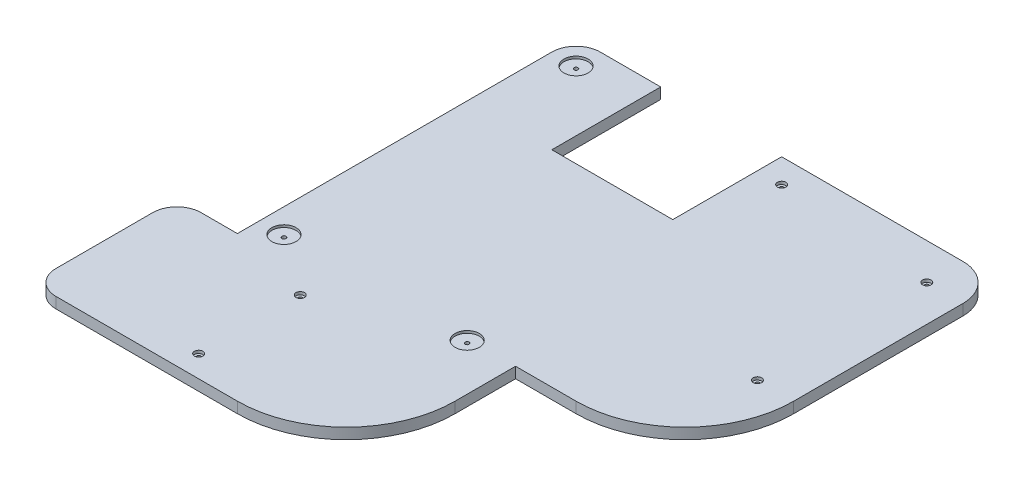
ISO-10303-21;
HEADER;
FILE_DESCRIPTION(('STEP AP214'),'2;1');
FILE_NAME('part.step','',(''),(''),'','','');
FILE_SCHEMA(('AUTOMOTIVE_DESIGN { 1 0 10303 214 1 1 1 1 }'));
ENDSEC;
DATA;
#1=APPLICATION_CONTEXT('core data for automotive mechanical design processes');
#2=APPLICATION_PROTOCOL_DEFINITION('international standard','automotive_design',2000,#1);
#3=PRODUCT_CONTEXT('',#1,'mechanical');
#4=PRODUCT('Part','Part','',(#3));
#5=PRODUCT_RELATED_PRODUCT_CATEGORY('part','',(#4));
#6=PRODUCT_DEFINITION_FORMATION('','',#4);
#7=PRODUCT_DEFINITION_CONTEXT('part definition',#1,'design');
#8=PRODUCT_DEFINITION('design','',#6,#7);
#9=PRODUCT_DEFINITION_SHAPE('','',#8);
#10=(LENGTH_UNIT() NAMED_UNIT(*) SI_UNIT(.MILLI.,.METRE.));
#11=(NAMED_UNIT(*) PLANE_ANGLE_UNIT() SI_UNIT($,.RADIAN.));
#12=(NAMED_UNIT(*) SI_UNIT($,.STERADIAN.) SOLID_ANGLE_UNIT());
#13=UNCERTAINTY_MEASURE_WITH_UNIT(LENGTH_MEASURE(1.E-05),#10,'distance_accuracy_value','');
#14=(GEOMETRIC_REPRESENTATION_CONTEXT(3) GLOBAL_UNCERTAINTY_ASSIGNED_CONTEXT((#13)) GLOBAL_UNIT_ASSIGNED_CONTEXT((#10,
#11,#12)) REPRESENTATION_CONTEXT('',''));
#15=CARTESIAN_POINT('',(0.,0.,0.));
#16=DIRECTION('',(0.,0.,1.));
#17=DIRECTION('',(1.,0.,0.));
#18=AXIS2_PLACEMENT_3D('',#15,#16,#17);
#19=CARTESIAN_POINT('',(-244.999999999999,110.,11.5000000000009));
#20=DIRECTION('',(0.,-1.,0.));
#21=DIRECTION('',(0.,0.,1.));
#22=AXIS2_PLACEMENT_3D('',#19,#20,#21);
#23=CYLINDRICAL_SURFACE('',#22,1.69999999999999);
#24=CARTESIAN_POINT('',(-244.999999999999,112.4,11.5000000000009));
#25=DIRECTION('',(0.,-1.,0.));
#26=DIRECTION('',(0.,0.,1.));
#27=AXIS2_PLACEMENT_3D('',#24,#25,#26);
#28=CIRCLE('',#27,1.7);
#29=CARTESIAN_POINT('',(-244.999999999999,112.4,13.2000000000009));
#30=VERTEX_POINT('',#29);
#31=EDGE_CURVE('E268',#30,#30,#28,.T.);
#32=ORIENTED_EDGE('',*,*,#31,.T.);
#33=EDGE_LOOP('',(#32));
#34=FACE_BOUND('',#33,.T.);
#35=CARTESIAN_POINT('',(-244.999999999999,117.,11.5000000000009));
#36=DIRECTION('',(0.,1.,0.));
#37=DIRECTION('',(0.,0.,-1.));
#38=AXIS2_PLACEMENT_3D('',#35,#36,#37);
#39=CIRCLE('',#38,1.69999999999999);
#40=CARTESIAN_POINT('',(-244.999999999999,117.,9.80000000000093));
#41=VERTEX_POINT('',#40);
#42=EDGE_CURVE('E248',#41,#41,#39,.F.);
#43=ORIENTED_EDGE('',*,*,#42,.F.);
#44=EDGE_LOOP('',(#43));
#45=FACE_BOUND('',#44,.T.);
#46=ADVANCED_FACE('F32',(#34,#45),#23,.F.);
#47=CARTESIAN_POINT('',(54.9999999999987,119.,-250.000000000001));
#48=DIRECTION('',(0.,0.,1.));
#49=DIRECTION('',(1.,0.,0.));
#50=AXIS2_PLACEMENT_3D('',#47,#48,#49);
#51=PLANE('',#50);
#52=DIRECTION('',(-1.,0.,0.));
#53=VECTOR('',#52,1.);
#54=CARTESIAN_POINT('',(54.9999999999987,119.,-250.000000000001));
#55=LINE('',#54,#53);
#56=CARTESIAN_POINT('',(-195.000000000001,119.,-250.));
#57=VERTEX_POINT('',#56);
#58=CARTESIAN_POINT('',(-245.000000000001,119.,-249.999999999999));
#59=VERTEX_POINT('',#58);
#60=EDGE_CURVE('E358',#57,#59,#55,.T.);
#61=ORIENTED_EDGE('',*,*,#60,.F.);
#62=DIRECTION('',(0.,1.,0.));
#63=VECTOR('',#62,1.);
#64=CARTESIAN_POINT('',(-195.000000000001,-125.536240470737,-250.));
#65=LINE('',#64,#63);
#66=CARTESIAN_POINT('',(-195.000000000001,110.,-250.));
#67=VERTEX_POINT('',#66);
#68=EDGE_CURVE('E328',#67,#57,#65,.T.);
#69=ORIENTED_EDGE('',*,*,#68,.F.);
#70=DIRECTION('',(-1.,0.,0.));
#71=VECTOR('',#70,1.);
#72=CARTESIAN_POINT('',(54.9999999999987,110.,-250.000000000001));
#73=LINE('',#72,#71);
#74=CARTESIAN_POINT('',(-245.000000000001,110.,-249.999999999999));
#75=VERTEX_POINT('',#74);
#76=EDGE_CURVE('E382',#67,#75,#73,.T.);
#77=ORIENTED_EDGE('',*,*,#76,.T.);
#78=DIRECTION('',(0.,-1.,0.));
#79=VECTOR('',#78,1.);
#80=CARTESIAN_POINT('',(-245.000000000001,119.,-249.999999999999));
#81=LINE('',#80,#79);
#82=EDGE_CURVE('E410',#75,#59,#81,.F.);
#83=ORIENTED_EDGE('',*,*,#82,.T.);
#84=EDGE_LOOP('',(#61,#69,#77,#83));
#85=FACE_BOUND('',#84,.T.);
#86=ADVANCED_FACE('F606',(#85),#51,.F.);
#87=CARTESIAN_POINT('',(-264.999999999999,119.,30.0000000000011));
#88=DIRECTION('',(0.,0.,1.));
#89=DIRECTION('',(1.,0.,0.));
#90=AXIS2_PLACEMENT_3D('',#87,#88,#89);
#91=PLANE('',#90);
#92=DIRECTION('',(-1.,0.,0.));
#93=VECTOR('',#92,1.);
#94=CARTESIAN_POINT('',(-264.999999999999,110.,30.0000000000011));
#95=LINE('',#94,#93);
#96=CARTESIAN_POINT('',(-264.999999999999,110.,30.0000000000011));
#97=VERTEX_POINT('',#96);
#98=CARTESIAN_POINT('',(-294.999999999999,110.,30.0000000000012));
#99=VERTEX_POINT('',#98);
#100=EDGE_CURVE('E338',#97,#99,#95,.T.);
#101=ORIENTED_EDGE('',*,*,#100,.T.);
#102=DIRECTION('',(0.,-1.,0.));
#103=VECTOR('',#102,1.);
#104=CARTESIAN_POINT('',(-294.999999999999,119.,30.0000000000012));
#105=LINE('',#104,#103);
#106=CARTESIAN_POINT('',(-294.999999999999,119.,30.0000000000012));
#107=VERTEX_POINT('',#106);
#108=EDGE_CURVE('E444',#99,#107,#105,.F.);
#109=ORIENTED_EDGE('',*,*,#108,.T.);
#110=DIRECTION('',(-1.,0.,0.));
#111=VECTOR('',#110,1.);
#112=CARTESIAN_POINT('',(-264.999999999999,119.,30.0000000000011));
#113=LINE('',#112,#111);
#114=CARTESIAN_POINT('',(-264.999999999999,119.,30.0000000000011));
#115=VERTEX_POINT('',#114);
#116=EDGE_CURVE('E339',#115,#107,#113,.T.);
#117=ORIENTED_EDGE('',*,*,#116,.F.);
#118=DIRECTION('',(0.,-1.,0.));
#119=VECTOR('',#118,1.);
#120=CARTESIAN_POINT('',(-264.999999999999,119.,30.0000000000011));
#121=LINE('',#120,#119);
#122=EDGE_CURVE('E364',#115,#97,#121,.T.);
#123=ORIENTED_EDGE('',*,*,#122,.T.);
#124=EDGE_LOOP('',(#101,#109,#117,#123));
#125=FACE_BOUND('',#124,.T.);
#126=ADVANCED_FACE('F614',(#125),#91,.F.);
#127=CARTESIAN_POINT('',(-314.999999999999,119.,30.0000000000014));
#128=DIRECTION('',(1.,0.,0.));
#129=DIRECTION('',(0.,0.,-1.));
#130=AXIS2_PLACEMENT_3D('',#127,#128,#129);
#131=PLANE('',#130);
#132=DIRECTION('',(0.,0.,1.));
#133=VECTOR('',#132,1.);
#134=CARTESIAN_POINT('',(-314.999999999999,119.,30.0000000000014));
#135=LINE('',#134,#133);
#136=CARTESIAN_POINT('',(-314.999999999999,119.,50.0000000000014));
#137=VERTEX_POINT('',#136);
#138=CARTESIAN_POINT('',(-314.999999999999,119.,130.000000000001));
#139=VERTEX_POINT('',#138);
#140=EDGE_CURVE('E342',#137,#139,#135,.T.);
#141=ORIENTED_EDGE('',*,*,#140,.F.);
#142=DIRECTION('',(0.,-1.,0.));
#143=VECTOR('',#142,1.);
#144=CARTESIAN_POINT('',(-314.999999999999,119.,50.0000000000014));
#145=LINE('',#144,#143);
#146=CARTESIAN_POINT('',(-314.999999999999,110.,50.0000000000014));
#147=VERTEX_POINT('',#146);
#148=EDGE_CURVE('E437',#137,#147,#145,.T.);
#149=ORIENTED_EDGE('',*,*,#148,.T.);
#150=DIRECTION('',(0.,0.,1.));
#151=VECTOR('',#150,1.);
#152=CARTESIAN_POINT('',(-314.999999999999,110.,30.0000000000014));
#153=LINE('',#152,#151);
#154=CARTESIAN_POINT('',(-314.999999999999,110.,130.000000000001));
#155=VERTEX_POINT('',#154);
#156=EDGE_CURVE('E367',#147,#155,#153,.T.);
#157=ORIENTED_EDGE('',*,*,#156,.T.);
#158=DIRECTION('',(0.,-1.,0.));
#159=VECTOR('',#158,1.);
#160=CARTESIAN_POINT('',(-314.999999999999,119.,130.000000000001));
#161=LINE('',#160,#159);
#162=EDGE_CURVE('E435',#155,#139,#161,.F.);
#163=ORIENTED_EDGE('',*,*,#162,.T.);
#164=EDGE_LOOP('',(#141,#149,#157,#163));
#165=FACE_BOUND('',#164,.T.);
#166=ADVANCED_FACE('F546',(#165),#131,.F.);
#167=CARTESIAN_POINT('',(-54.9999999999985,119.,150.));
#168=DIRECTION('',(0.,0.,-1.));
#169=DIRECTION('',(-1.,0.,0.));
#170=AXIS2_PLACEMENT_3D('',#167,#168,#169);
#171=PLANE('',#170);
#172=DIRECTION('',(1.,0.,0.));
#173=VECTOR('',#172,1.);
#174=CARTESIAN_POINT('',(-54.9999999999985,119.,150.));
#175=LINE('',#174,#173);
#176=CARTESIAN_POINT('',(-294.999999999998,119.,150.000000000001));
#177=VERTEX_POINT('',#176);
#178=CARTESIAN_POINT('',(-144.999999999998,119.,150.));
#179=VERTEX_POINT('',#178);
#180=EDGE_CURVE('E346',#177,#179,#175,.T.);
#181=ORIENTED_EDGE('',*,*,#180,.F.);
#182=DIRECTION('',(0.,-1.,0.));
#183=VECTOR('',#182,1.);
#184=CARTESIAN_POINT('',(-294.999999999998,119.,150.000000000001));
#185=LINE('',#184,#183);
#186=CARTESIAN_POINT('',(-294.999999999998,110.,150.000000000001));
#187=VERTEX_POINT('',#186);
#188=EDGE_CURVE('E450',#177,#187,#185,.T.);
#189=ORIENTED_EDGE('',*,*,#188,.T.);
#190=DIRECTION('',(1.,0.,0.));
#191=VECTOR('',#190,1.);
#192=CARTESIAN_POINT('',(-54.9999999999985,110.,150.));
#193=LINE('',#192,#191);
#194=CARTESIAN_POINT('',(-144.999999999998,110.,150.));
#195=VERTEX_POINT('',#194);
#196=EDGE_CURVE('E370',#187,#195,#193,.T.);
#197=ORIENTED_EDGE('',*,*,#196,.T.);
#198=DIRECTION('',(0.,-1.,0.));
#199=VECTOR('',#198,1.);
#200=CARTESIAN_POINT('',(-144.999999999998,119.,150.));
#201=LINE('',#200,#199);
#202=EDGE_CURVE('E430',#195,#179,#201,.F.);
#203=ORIENTED_EDGE('',*,*,#202,.T.);
#204=EDGE_LOOP('',(#181,#189,#197,#203));
#205=FACE_BOUND('',#204,.T.);
#206=ADVANCED_FACE('F556',(#205),#171,.F.);
#207=CARTESIAN_POINT('',(-54.9999999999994,119.,9.99999999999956));
#208=DIRECTION('',(-1.,0.,0.));
#209=DIRECTION('',(0.,0.,1.));
#210=AXIS2_PLACEMENT_3D('',#207,#208,#209);
#211=PLANE('',#210);
#212=DIRECTION('',(0.,0.,-1.));
#213=VECTOR('',#212,1.);
#214=CARTESIAN_POINT('',(-54.9999999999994,119.,9.99999999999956));
#215=LINE('',#214,#213);
#216=CARTESIAN_POINT('',(-54.9999999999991,119.,59.9999999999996));
#217=VERTEX_POINT('',#216);
#218=CARTESIAN_POINT('',(-54.9999999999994,119.,9.99999999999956));
#219=VERTEX_POINT('',#218);
#220=EDGE_CURVE('E348',#217,#219,#215,.T.);
#221=ORIENTED_EDGE('',*,*,#220,.F.);
#222=DIRECTION('',(0.,-1.,0.));
#223=VECTOR('',#222,1.);
#224=CARTESIAN_POINT('',(-54.9999999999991,119.,59.9999999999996));
#225=LINE('',#224,#223);
#226=CARTESIAN_POINT('',(-54.9999999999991,110.,59.9999999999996));
#227=VERTEX_POINT('',#226);
#228=EDGE_CURVE('E424',#217,#227,#225,.T.);
#229=ORIENTED_EDGE('',*,*,#228,.T.);
#230=DIRECTION('',(0.,0.,-1.));
#231=VECTOR('',#230,1.);
#232=CARTESIAN_POINT('',(-54.9999999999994,110.,9.99999999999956));
#233=LINE('',#232,#231);
#234=CARTESIAN_POINT('',(-54.9999999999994,110.,9.99999999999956));
#235=VERTEX_POINT('',#234);
#236=EDGE_CURVE('E372',#227,#235,#233,.T.);
#237=ORIENTED_EDGE('',*,*,#236,.T.);
#238=DIRECTION('',(0.,-1.,0.));
#239=VECTOR('',#238,1.);
#240=CARTESIAN_POINT('',(-54.9999999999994,119.,9.99999999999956));
#241=LINE('',#240,#239);
#242=EDGE_CURVE('E401',#219,#235,#241,.T.);
#243=ORIENTED_EDGE('',*,*,#242,.F.);
#244=EDGE_LOOP('',(#221,#229,#237,#243));
#245=FACE_BOUND('',#244,.T.);
#246=ADVANCED_FACE('F564',(#245),#211,.F.);
#247=CARTESIAN_POINT('',(-54.9999999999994,119.,9.99999999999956));
#248=DIRECTION('',(0.,0.,-1.));
#249=DIRECTION('',(-1.,0.,0.));
#250=AXIS2_PLACEMENT_3D('',#247,#248,#249);
#251=PLANE('',#250);
#252=DIRECTION('',(1.,0.,0.));
#253=VECTOR('',#252,1.);
#254=CARTESIAN_POINT('',(-54.9999999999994,110.,9.99999999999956));
#255=LINE('',#254,#253);
#256=CARTESIAN_POINT('',(-4.99999999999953,110.,9.99999999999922));
#257=VERTEX_POINT('',#256);
#258=EDGE_CURVE('E374',#235,#257,#255,.T.);
#259=ORIENTED_EDGE('',*,*,#258,.T.);
#260=DIRECTION('',(0.,-1.,0.));
#261=VECTOR('',#260,1.);
#262=CARTESIAN_POINT('',(-4.99999999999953,119.,9.99999999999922));
#263=LINE('',#262,#261);
#264=CARTESIAN_POINT('',(-4.99999999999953,119.,9.99999999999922));
#265=VERTEX_POINT('',#264);
#266=EDGE_CURVE('E398',#265,#257,#263,.T.);
#267=ORIENTED_EDGE('',*,*,#266,.F.);
#268=DIRECTION('',(1.,0.,0.));
#269=VECTOR('',#268,1.);
#270=CARTESIAN_POINT('',(-54.9999999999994,119.,9.99999999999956));
#271=LINE('',#270,#269);
#272=EDGE_CURVE('E350',#219,#265,#271,.T.);
#273=ORIENTED_EDGE('',*,*,#272,.F.);
#274=ORIENTED_EDGE('',*,*,#242,.T.);
#275=EDGE_LOOP('',(#259,#267,#273,#274));
#276=FACE_BOUND('',#275,.T.);
#277=ADVANCED_FACE('F571',(#276),#251,.F.);
#278=CARTESIAN_POINT('',(-5.00000000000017,119.,-80.0000000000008));
#279=DIRECTION('',(0.,-1.,0.));
#280=DIRECTION('',(0.,0.,1.));
#281=AXIS2_PLACEMENT_3D('',#278,#279,#280);
#282=CYLINDRICAL_SURFACE('',#281,90.);
#283=CARTESIAN_POINT('',(-5.00000000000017,110.,-80.0000000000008));
#284=DIRECTION('',(0.,1.,0.));
#285=DIRECTION('',(0.,0.,-1.));
#286=AXIS2_PLACEMENT_3D('',#283,#284,#285);
#287=CIRCLE('',#286,90.);
#288=CARTESIAN_POINT('',(84.9999999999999,110.,-80.0000000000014));
#289=VERTEX_POINT('',#288);
#290=EDGE_CURVE('E376',#257,#289,#287,.T.);
#291=ORIENTED_EDGE('',*,*,#290,.T.);
#292=DIRECTION('',(0.,-1.,0.));
#293=VECTOR('',#292,1.);
#294=CARTESIAN_POINT('',(84.9999999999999,119.,-80.0000000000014));
#295=LINE('',#294,#293);
#296=CARTESIAN_POINT('',(84.9999999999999,119.,-80.0000000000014));
#297=VERTEX_POINT('',#296);
#298=EDGE_CURVE('E395',#297,#289,#295,.T.);
#299=ORIENTED_EDGE('',*,*,#298,.F.);
#300=CARTESIAN_POINT('',(-5.00000000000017,119.,-80.0000000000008));
#301=DIRECTION('',(0.,1.,0.));
#302=DIRECTION('',(0.,0.,-1.));
#303=AXIS2_PLACEMENT_3D('',#300,#301,#302);
#304=CIRCLE('',#303,90.);
#305=EDGE_CURVE('E352',#265,#297,#304,.T.);
#306=ORIENTED_EDGE('',*,*,#305,.F.);
#307=ORIENTED_EDGE('',*,*,#266,.T.);
#308=EDGE_LOOP('',(#291,#299,#306,#307));
#309=FACE_BOUND('',#308,.T.);
#310=ADVANCED_FACE('F578',(#309),#282,.T.);
#311=CARTESIAN_POINT('',(84.9999999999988,119.,-220.000000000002));
#312=DIRECTION('',(-1.,0.,0.));
#313=DIRECTION('',(0.,0.,1.));
#314=AXIS2_PLACEMENT_3D('',#311,#312,#313);
#315=PLANE('',#314);
#316=DIRECTION('',(0.,0.,-1.));
#317=VECTOR('',#316,1.);
#318=CARTESIAN_POINT('',(84.9999999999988,110.,-220.000000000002));
#319=LINE('',#318,#317);
#320=CARTESIAN_POINT('',(84.9999999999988,110.,-220.000000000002));
#321=VERTEX_POINT('',#320);
#322=EDGE_CURVE('E378',#289,#321,#319,.T.);
#323=ORIENTED_EDGE('',*,*,#322,.T.);
#324=DIRECTION('',(0.,-1.,0.));
#325=VECTOR('',#324,1.);
#326=CARTESIAN_POINT('',(84.9999999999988,119.,-220.000000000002));
#327=LINE('',#326,#325);
#328=CARTESIAN_POINT('',(84.9999999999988,119.,-220.000000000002));
#329=VERTEX_POINT('',#328);
#330=EDGE_CURVE('E392',#329,#321,#327,.T.);
#331=ORIENTED_EDGE('',*,*,#330,.F.);
#332=DIRECTION('',(0.,0.,-1.));
#333=VECTOR('',#332,1.);
#334=CARTESIAN_POINT('',(84.9999999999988,119.,-220.000000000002));
#335=LINE('',#334,#333);
#336=EDGE_CURVE('E354',#297,#329,#335,.T.);
#337=ORIENTED_EDGE('',*,*,#336,.F.);
#338=ORIENTED_EDGE('',*,*,#298,.T.);
#339=EDGE_LOOP('',(#323,#331,#337,#338));
#340=FACE_BOUND('',#339,.T.);
#341=ADVANCED_FACE('F581',(#340),#315,.F.);
#342=CARTESIAN_POINT('',(54.9999999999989,119.,-220.000000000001));
#343=DIRECTION('',(0.,-1.,0.));
#344=DIRECTION('',(0.,0.,1.));
#345=AXIS2_PLACEMENT_3D('',#342,#343,#344);
#346=CYLINDRICAL_SURFACE('',#345,29.9999999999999);
#347=CARTESIAN_POINT('',(54.9999999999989,110.,-220.000000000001));
#348=DIRECTION('',(0.,1.,0.));
#349=DIRECTION('',(0.,0.,-1.));
#350=AXIS2_PLACEMENT_3D('',#347,#348,#349);
#351=CIRCLE('',#350,29.9999999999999);
#352=CARTESIAN_POINT('',(54.9999999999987,110.,-250.000000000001));
#353=VERTEX_POINT('',#352);
#354=EDGE_CURVE('E380',#321,#353,#351,.T.);
#355=ORIENTED_EDGE('',*,*,#354,.T.);
#356=DIRECTION('',(0.,-1.,0.));
#357=VECTOR('',#356,1.);
#358=CARTESIAN_POINT('',(54.9999999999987,119.,-250.000000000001));
#359=LINE('',#358,#357);
#360=CARTESIAN_POINT('',(54.9999999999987,119.,-250.000000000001));
#361=VERTEX_POINT('',#360);
#362=EDGE_CURVE('E389',#361,#353,#359,.T.);
#363=ORIENTED_EDGE('',*,*,#362,.F.);
#364=CARTESIAN_POINT('',(54.9999999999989,119.,-220.000000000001));
#365=DIRECTION('',(0.,1.,0.));
#366=DIRECTION('',(0.,0.,-1.));
#367=AXIS2_PLACEMENT_3D('',#364,#365,#366);
#368=CIRCLE('',#367,29.9999999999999);
#369=EDGE_CURVE('E356',#329,#361,#368,.T.);
#370=ORIENTED_EDGE('',*,*,#369,.F.);
#371=ORIENTED_EDGE('',*,*,#330,.T.);
#372=EDGE_LOOP('',(#355,#363,#370,#371));
#373=FACE_BOUND('',#372,.T.);
#374=ADVANCED_FACE('F586',(#373),#346,.T.);
#375=CARTESIAN_POINT('',(-95.0000000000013,110.,-250.));
#376=VERTEX_POINT('',#375);
#377=EDGE_CURVE('E383',#353,#376,#73,.T.);
#378=ORIENTED_EDGE('',*,*,#377,.T.);
#379=DIRECTION('',(0.,1.,0.));
#380=VECTOR('',#379,1.);
#381=CARTESIAN_POINT('',(-95.0000000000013,-125.536240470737,-250.));
#382=LINE('',#381,#380);
#383=CARTESIAN_POINT('',(-95.0000000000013,119.,-250.));
#384=VERTEX_POINT('',#383);
#385=EDGE_CURVE('E324',#376,#384,#382,.T.);
#386=ORIENTED_EDGE('',*,*,#385,.T.);
#387=EDGE_CURVE('E359',#361,#384,#55,.T.);
#388=ORIENTED_EDGE('',*,*,#387,.F.);
#389=ORIENTED_EDGE('',*,*,#362,.T.);
#390=EDGE_LOOP('',(#378,#386,#388,#389));
#391=FACE_BOUND('',#390,.T.);
#392=ADVANCED_FACE('F591',(#391),#51,.F.);
#393=CARTESIAN_POINT('',(-265.000000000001,119.,-249.999999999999));
#394=DIRECTION('',(1.,0.,0.));
#395=DIRECTION('',(0.,0.,-1.));
#396=AXIS2_PLACEMENT_3D('',#393,#394,#395);
#397=PLANE('',#396);
#398=DIRECTION('',(0.,0.,1.));
#399=VECTOR('',#398,1.);
#400=CARTESIAN_POINT('',(-265.000000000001,119.,-249.999999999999));
#401=LINE('',#400,#399);
#402=CARTESIAN_POINT('',(-265.000000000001,119.,-229.999999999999));
#403=VERTEX_POINT('',#402);
#404=EDGE_CURVE('E362',#403,#115,#401,.T.);
#405=ORIENTED_EDGE('',*,*,#404,.F.);
#406=DIRECTION('',(0.,-1.,0.));
#407=VECTOR('',#406,1.);
#408=CARTESIAN_POINT('',(-265.000000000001,119.,-229.999999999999));
#409=LINE('',#408,#407);
#410=CARTESIAN_POINT('',(-265.000000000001,110.,-229.999999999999));
#411=VERTEX_POINT('',#410);
#412=EDGE_CURVE('E404',#403,#411,#409,.T.);
#413=ORIENTED_EDGE('',*,*,#412,.T.);
#414=DIRECTION('',(0.,0.,1.));
#415=VECTOR('',#414,1.);
#416=CARTESIAN_POINT('',(-265.000000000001,110.,-249.999999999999));
#417=LINE('',#416,#415);
#418=EDGE_CURVE('E343',#411,#97,#417,.T.);
#419=ORIENTED_EDGE('',*,*,#418,.T.);
#420=ORIENTED_EDGE('',*,*,#122,.F.);
#421=EDGE_LOOP('',(#405,#413,#419,#420));
#422=FACE_BOUND('',#421,.T.);
#423=ADVANCED_FACE('F521',(#422),#397,.F.);
#424=CARTESIAN_POINT('',(-5.00000000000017,119.,-80.0000000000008));
#425=DIRECTION('',(0.,1.,0.));
#426=DIRECTION('',(0.,0.,-1.));
#427=AXIS2_PLACEMENT_3D('',#424,#425,#426);
#428=PLANE('',#427);
#429=CARTESIAN_POINT('',(-245.000000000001,119.,-229.999999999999));
#430=DIRECTION('',(0.,1.,0.));
#431=DIRECTION('',(0.,0.,-1.));
#432=AXIS2_PLACEMENT_3D('',#429,#430,#431);
#433=CIRCLE('',#432,10.);
#434=CARTESIAN_POINT('',(-245.000000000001,119.,-239.999999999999));
#435=VERTEX_POINT('',#434);
#436=EDGE_CURVE('E500',#435,#435,#433,.T.);
#437=ORIENTED_EDGE('',*,*,#436,.F.);
#438=EDGE_LOOP('',(#437));
#439=FACE_BOUND('',#438,.T.);
#440=CARTESIAN_POINT('',(-93.4999999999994,119.,11.4999999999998));
#441=DIRECTION('',(0.,1.,0.));
#442=DIRECTION('',(0.,0.,-1.));
#443=AXIS2_PLACEMENT_3D('',#440,#441,#442);
#444=CIRCLE('',#443,9.99999999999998);
#445=CARTESIAN_POINT('',(-93.4999999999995,119.,1.49999999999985));
#446=VERTEX_POINT('',#445);
#447=EDGE_CURVE('E506',#446,#446,#444,.T.);
#448=ORIENTED_EDGE('',*,*,#447,.F.);
#449=EDGE_LOOP('',(#448));
#450=FACE_BOUND('',#449,.T.);
#451=CARTESIAN_POINT('',(-244.999999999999,119.,11.5000000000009));
#452=DIRECTION('',(0.,1.,0.));
#453=DIRECTION('',(0.,0.,-1.));
#454=AXIS2_PLACEMENT_3D('',#451,#452,#453);
#455=CIRCLE('',#454,10.);
#456=CARTESIAN_POINT('',(-244.999999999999,119.,1.50000000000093));
#457=VERTEX_POINT('',#456);
#458=EDGE_CURVE('E232',#457,#457,#455,.T.);
#459=ORIENTED_EDGE('',*,*,#458,.F.);
#460=EDGE_LOOP('',(#459));
#461=FACE_BOUND('',#460,.T.);
#462=CARTESIAN_POINT('',(54.9999999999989,119.,-220.000000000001));
#463=DIRECTION('',(0.,1.,0.));
#464=DIRECTION('',(0.,0.,-1.));
#465=AXIS2_PLACEMENT_3D('',#462,#463,#464);
#466=CIRCLE('',#465,3.5);
#467=CARTESIAN_POINT('',(54.9999999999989,119.,-223.500000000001));
#468=VERTEX_POINT('',#467);
#469=EDGE_CURVE('E271',#468,#468,#466,.T.);
#470=ORIENTED_EDGE('',*,*,#469,.F.);
#471=EDGE_LOOP('',(#470));
#472=FACE_BOUND('',#471,.T.);
#473=CARTESIAN_POINT('',(54.9999999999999,119.,-80.0000000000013));
#474=DIRECTION('',(0.,1.,0.));
#475=DIRECTION('',(0.,0.,-1.));
#476=AXIS2_PLACEMENT_3D('',#473,#474,#475);
#477=CIRCLE('',#476,3.5);
#478=CARTESIAN_POINT('',(54.9999999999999,119.,-83.5000000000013));
#479=VERTEX_POINT('',#478);
#480=EDGE_CURVE('E281',#479,#479,#477,.T.);
#481=ORIENTED_EDGE('',*,*,#480,.F.);
#482=EDGE_LOOP('',(#481));
#483=FACE_BOUND('',#482,.T.);
#484=CARTESIAN_POINT('',(-75.0000000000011,119.,-230.));
#485=DIRECTION('',(0.,1.,0.));
#486=DIRECTION('',(0.,0.,-1.));
#487=AXIS2_PLACEMENT_3D('',#484,#485,#486);
#488=CIRCLE('',#487,3.5);
#489=CARTESIAN_POINT('',(-75.0000000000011,119.,-233.5));
#490=VERTEX_POINT('',#489);
#491=EDGE_CURVE('E291',#490,#490,#488,.T.);
#492=ORIENTED_EDGE('',*,*,#491,.F.);
#493=EDGE_LOOP('',(#492));
#494=FACE_BOUND('',#493,.T.);
#495=CARTESIAN_POINT('',(-194.999999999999,119.,132.000000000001));
#496=DIRECTION('',(0.,1.,0.));
#497=DIRECTION('',(0.,0.,-1.));
#498=AXIS2_PLACEMENT_3D('',#495,#496,#497);
#499=CIRCLE('',#498,3.5);
#500=CARTESIAN_POINT('',(-194.999999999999,119.,128.500000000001));
#501=VERTEX_POINT('',#500);
#502=EDGE_CURVE('E301',#501,#501,#499,.T.);
#503=ORIENTED_EDGE('',*,*,#502,.F.);
#504=EDGE_LOOP('',(#503));
#505=FACE_BOUND('',#504,.T.);
#506=CARTESIAN_POINT('',(-194.999999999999,119.,48.0000000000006));
#507=DIRECTION('',(0.,1.,0.));
#508=DIRECTION('',(0.,0.,-1.));
#509=AXIS2_PLACEMENT_3D('',#506,#507,#508);
#510=CIRCLE('',#509,3.5);
#511=CARTESIAN_POINT('',(-194.999999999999,119.,44.5000000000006));
#512=VERTEX_POINT('',#511);
#513=EDGE_CURVE('E311',#512,#512,#510,.T.);
#514=ORIENTED_EDGE('',*,*,#513,.F.);
#515=EDGE_LOOP('',(#514));
#516=FACE_BOUND('',#515,.T.);
#517=ORIENTED_EDGE('',*,*,#116,.T.);
#518=CARTESIAN_POINT('',(-294.999999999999,119.,50.0000000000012));
#519=DIRECTION('',(0.,1.,0.));
#520=DIRECTION('',(0.,0.,-1.));
#521=AXIS2_PLACEMENT_3D('',#518,#519,#520);
#522=CIRCLE('',#521,20.);
#523=EDGE_CURVE('E448',#107,#137,#522,.T.);
#524=ORIENTED_EDGE('',*,*,#523,.T.);
#525=ORIENTED_EDGE('',*,*,#140,.T.);
#526=CARTESIAN_POINT('',(-294.999999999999,119.,130.000000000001));
#527=DIRECTION('',(0.,1.,0.));
#528=DIRECTION('',(0.,0.,-1.));
#529=AXIS2_PLACEMENT_3D('',#526,#527,#528);
#530=CIRCLE('',#529,20.);
#531=EDGE_CURVE('E446',#139,#177,#530,.T.);
#532=ORIENTED_EDGE('',*,*,#531,.T.);
#533=ORIENTED_EDGE('',*,*,#180,.T.);
#534=CARTESIAN_POINT('',(-144.999999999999,119.,60.0000000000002));
#535=DIRECTION('',(0.,1.,0.));
#536=DIRECTION('',(0.,0.,-1.));
#537=AXIS2_PLACEMENT_3D('',#534,#535,#536);
#538=CIRCLE('',#537,90.);
#539=EDGE_CURVE('E433',#179,#217,#538,.T.);
#540=ORIENTED_EDGE('',*,*,#539,.T.);
#541=ORIENTED_EDGE('',*,*,#220,.T.);
#542=ORIENTED_EDGE('',*,*,#272,.T.);
#543=ORIENTED_EDGE('',*,*,#305,.T.);
#544=ORIENTED_EDGE('',*,*,#336,.T.);
#545=ORIENTED_EDGE('',*,*,#369,.T.);
#546=ORIENTED_EDGE('',*,*,#387,.T.);
#547=DIRECTION('',(0.,0.,-1.));
#548=VECTOR('',#547,1.);
#549=CARTESIAN_POINT('',(-95.0000000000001,119.,-80.0000000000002));
#550=LINE('',#549,#548);
#551=CARTESIAN_POINT('',(-95.0000000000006,119.,-160.));
#552=VERTEX_POINT('',#551);
#553=EDGE_CURVE('E332',#552,#384,#550,.T.);
#554=ORIENTED_EDGE('',*,*,#553,.F.);
#555=DIRECTION('',(1.,0.,0.));
#556=VECTOR('',#555,1.);
#557=CARTESIAN_POINT('',(-5.00000000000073,119.,-160.000000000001));
#558=LINE('',#557,#556);
#559=CARTESIAN_POINT('',(-195.000000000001,119.,-160.));
#560=VERTEX_POINT('',#559);
#561=EDGE_CURVE('E334',#560,#552,#558,.T.);
#562=ORIENTED_EDGE('',*,*,#561,.F.);
#563=DIRECTION('',(0.,0.,1.));
#564=VECTOR('',#563,1.);
#565=CARTESIAN_POINT('',(-195.,119.,-79.9999999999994));
#566=LINE('',#565,#564);
#567=EDGE_CURVE('E336',#57,#560,#566,.T.);
#568=ORIENTED_EDGE('',*,*,#567,.F.);
#569=ORIENTED_EDGE('',*,*,#60,.T.);
#570=CARTESIAN_POINT('',(-245.000000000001,119.,-229.999999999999));
#571=DIRECTION('',(0.,1.,0.));
#572=DIRECTION('',(0.,0.,-1.));
#573=AXIS2_PLACEMENT_3D('',#570,#571,#572);
#574=CIRCLE('',#573,20.);
#575=EDGE_CURVE('E413',#59,#403,#574,.T.);
#576=ORIENTED_EDGE('',*,*,#575,.T.);
#577=ORIENTED_EDGE('',*,*,#404,.T.);
#578=EDGE_LOOP('',(#517,#524,#525,#532,#533,#540,#541,#542,#543,#544,#545,#546,#554,#562,#568,
#569,#576,#577));
#579=FACE_BOUND('',#578,.T.);
#580=ADVANCED_FACE('F517',(#439,#450,#461,#472,#483,#494,#505,#516,#579),#428,.T.);
#581=CARTESIAN_POINT('',(-5.00000000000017,110.,-80.0000000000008));
#582=DIRECTION('',(0.,1.,0.));
#583=DIRECTION('',(0.,0.,-1.));
#584=AXIS2_PLACEMENT_3D('',#581,#582,#583);
#585=PLANE('',#584);
#586=CARTESIAN_POINT('',(-93.4999999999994,110.,11.4999999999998));
#587=DIRECTION('',(0.,1.,0.));
#588=DIRECTION('',(0.,0.,-1.));
#589=AXIS2_PLACEMENT_3D('',#586,#587,#588);
#590=CIRCLE('',#589,1.59999999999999);
#591=CARTESIAN_POINT('',(-93.4999999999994,110.,9.89999999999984));
#592=VERTEX_POINT('',#591);
#593=EDGE_CURVE('E494',#592,#592,#590,.T.);
#594=ORIENTED_EDGE('',*,*,#593,.T.);
#595=EDGE_LOOP('',(#594));
#596=FACE_BOUND('',#595,.T.);
#597=CARTESIAN_POINT('',(-245.000000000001,110.,-229.999999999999));
#598=DIRECTION('',(0.,1.,0.));
#599=DIRECTION('',(0.,0.,-1.));
#600=AXIS2_PLACEMENT_3D('',#597,#598,#599);
#601=CIRCLE('',#600,1.6);
#602=CARTESIAN_POINT('',(-245.000000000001,110.,-231.599999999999));
#603=VERTEX_POINT('',#602);
#604=EDGE_CURVE('E486',#603,#603,#601,.T.);
#605=ORIENTED_EDGE('',*,*,#604,.T.);
#606=EDGE_LOOP('',(#605));
#607=FACE_BOUND('',#606,.T.);
#608=DIRECTION('',(1.,0.,0.));
#609=VECTOR('',#608,1.);
#610=CARTESIAN_POINT('',(-4.99999999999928,110.,47.9999999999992));
#611=LINE('',#610,#609);
#612=CARTESIAN_POINT('',(-274.999999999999,110.,48.0000000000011));
#613=VERTEX_POINT('',#612);
#614=CARTESIAN_POINT('',(-239.999999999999,110.,48.0000000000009));
#615=VERTEX_POINT('',#614);
#616=EDGE_CURVE('E475',#613,#615,#611,.T.);
#617=ORIENTED_EDGE('',*,*,#616,.T.);
#618=DIRECTION('',(0.,0.,-1.));
#619=VECTOR('',#618,1.);
#620=CARTESIAN_POINT('',(-240.,110.,-79.9999999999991));
#621=LINE('',#620,#619);
#622=CARTESIAN_POINT('',(-239.999999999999,110.,39.0000000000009));
#623=VERTEX_POINT('',#622);
#624=EDGE_CURVE('E11',#615,#623,#621,.T.);
#625=ORIENTED_EDGE('',*,*,#624,.T.);
#626=DIRECTION('',(-1.,0.,0.));
#627=VECTOR('',#626,1.);
#628=CARTESIAN_POINT('',(-4.99999999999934,110.,38.9999999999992));
#629=LINE('',#628,#627);
#630=CARTESIAN_POINT('',(-274.999999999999,110.,39.0000000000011));
#631=VERTEX_POINT('',#630);
#632=EDGE_CURVE('E41',#623,#631,#629,.T.);
#633=ORIENTED_EDGE('',*,*,#632,.T.);
#634=DIRECTION('',(0.,0.,1.));
#635=VECTOR('',#634,1.);
#636=CARTESIAN_POINT('',(-275.,110.,-79.9999999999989));
#637=LINE('',#636,#635);
#638=EDGE_CURVE('E477',#631,#613,#637,.T.);
#639=ORIENTED_EDGE('',*,*,#638,.T.);
#640=EDGE_LOOP('',(#617,#625,#633,#639));
#641=FACE_BOUND('',#640,.T.);
#642=DIRECTION('',(1.,0.,0.));
#643=VECTOR('',#642,1.);
#644=CARTESIAN_POINT('',(-4.99999999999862,110.,140.999999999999));
#645=LINE('',#644,#643);
#646=CARTESIAN_POINT('',(-274.999999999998,110.,141.000000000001));
#647=VERTEX_POINT('',#646);
#648=CARTESIAN_POINT('',(-239.999999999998,110.,141.000000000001));
#649=VERTEX_POINT('',#648);
#650=EDGE_CURVE('E453',#647,#649,#645,.T.);
#651=ORIENTED_EDGE('',*,*,#650,.T.);
#652=DIRECTION('',(0.,0.,-1.));
#653=VECTOR('',#652,1.);
#654=CARTESIAN_POINT('',(-240.,110.,-79.9999999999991));
#655=LINE('',#654,#653);
#656=CARTESIAN_POINT('',(-239.999999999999,110.,132.000000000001));
#657=VERTEX_POINT('',#656);
#658=EDGE_CURVE('E472',#649,#657,#655,.T.);
#659=ORIENTED_EDGE('',*,*,#658,.T.);
#660=DIRECTION('',(-1.,0.,0.));
#661=VECTOR('',#660,1.);
#662=CARTESIAN_POINT('',(-4.9999999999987,110.,131.999999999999));
#663=LINE('',#662,#661);
#664=CARTESIAN_POINT('',(-274.999999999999,110.,132.000000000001));
#665=VERTEX_POINT('',#664);
#666=EDGE_CURVE('E469',#657,#665,#663,.T.);
#667=ORIENTED_EDGE('',*,*,#666,.T.);
#668=DIRECTION('',(0.,0.,1.));
#669=VECTOR('',#668,1.);
#670=CARTESIAN_POINT('',(-275.,110.,-79.9999999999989));
#671=LINE('',#670,#669);
#672=EDGE_CURVE('E466',#665,#647,#671,.T.);
#673=ORIENTED_EDGE('',*,*,#672,.T.);
#674=EDGE_LOOP('',(#651,#659,#667,#673));
#675=FACE_BOUND('',#674,.T.);
#676=CARTESIAN_POINT('',(-244.999999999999,110.,11.5000000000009));
#677=DIRECTION('',(0.,-1.,0.));
#678=DIRECTION('',(0.,0.,1.));
#679=AXIS2_PLACEMENT_3D('',#676,#677,#678);
#680=CIRCLE('',#679,3.5);
#681=CARTESIAN_POINT('',(-244.999999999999,110.,15.0000000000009));
#682=VERTEX_POINT('',#681);
#683=EDGE_CURVE('E239',#682,#682,#680,.T.);
#684=ORIENTED_EDGE('',*,*,#683,.F.);
#685=EDGE_LOOP('',(#684));
#686=FACE_BOUND('',#685,.T.);
#687=CARTESIAN_POINT('',(54.9999999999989,110.,-220.000000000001));
#688=DIRECTION('',(0.,1.,0.));
#689=DIRECTION('',(0.,0.,-1.));
#690=AXIS2_PLACEMENT_3D('',#687,#688,#689);
#691=CIRCLE('',#690,1.59999999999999);
#692=CARTESIAN_POINT('',(54.9999999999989,110.,-221.600000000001));
#693=VERTEX_POINT('',#692);
#694=EDGE_CURVE('E280',#693,#693,#691,.T.);
#695=ORIENTED_EDGE('',*,*,#694,.T.);
#696=EDGE_LOOP('',(#695));
#697=FACE_BOUND('',#696,.T.);
#698=CARTESIAN_POINT('',(54.9999999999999,110.,-80.0000000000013));
#699=DIRECTION('',(0.,1.,0.));
#700=DIRECTION('',(0.,0.,-1.));
#701=AXIS2_PLACEMENT_3D('',#698,#699,#700);
#702=CIRCLE('',#701,1.59999999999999);
#703=CARTESIAN_POINT('',(54.9999999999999,110.,-81.6000000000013));
#704=VERTEX_POINT('',#703);
#705=EDGE_CURVE('E290',#704,#704,#702,.T.);
#706=ORIENTED_EDGE('',*,*,#705,.T.);
#707=EDGE_LOOP('',(#706));
#708=FACE_BOUND('',#707,.T.);
#709=CARTESIAN_POINT('',(-75.0000000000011,110.,-230.));
#710=DIRECTION('',(0.,1.,0.));
#711=DIRECTION('',(0.,0.,-1.));
#712=AXIS2_PLACEMENT_3D('',#709,#710,#711);
#713=CIRCLE('',#712,1.59999999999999);
#714=CARTESIAN_POINT('',(-75.0000000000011,110.,-231.6));
#715=VERTEX_POINT('',#714);
#716=EDGE_CURVE('E300',#715,#715,#713,.T.);
#717=ORIENTED_EDGE('',*,*,#716,.T.);
#718=EDGE_LOOP('',(#717));
#719=FACE_BOUND('',#718,.T.);
#720=CARTESIAN_POINT('',(-194.999999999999,110.,132.000000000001));
#721=DIRECTION('',(0.,1.,0.));
#722=DIRECTION('',(0.,0.,-1.));
#723=AXIS2_PLACEMENT_3D('',#720,#721,#722);
#724=CIRCLE('',#723,1.6);
#725=CARTESIAN_POINT('',(-194.999999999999,110.,130.400000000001));
#726=VERTEX_POINT('',#725);
#727=EDGE_CURVE('E310',#726,#726,#724,.T.);
#728=ORIENTED_EDGE('',*,*,#727,.T.);
#729=EDGE_LOOP('',(#728));
#730=FACE_BOUND('',#729,.T.);
#731=CARTESIAN_POINT('',(-194.999999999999,110.,48.0000000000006));
#732=DIRECTION('',(0.,1.,0.));
#733=DIRECTION('',(0.,0.,-1.));
#734=AXIS2_PLACEMENT_3D('',#731,#732,#733);
#735=CIRCLE('',#734,1.6);
#736=CARTESIAN_POINT('',(-194.999999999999,110.,46.4000000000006));
#737=VERTEX_POINT('',#736);
#738=EDGE_CURVE('E320',#737,#737,#735,.T.);
#739=ORIENTED_EDGE('',*,*,#738,.T.);
#740=EDGE_LOOP('',(#739));
#741=FACE_BOUND('',#740,.T.);
#742=ORIENTED_EDGE('',*,*,#156,.F.);
#743=CARTESIAN_POINT('',(-294.999999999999,110.,50.0000000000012));
#744=DIRECTION('',(0.,1.,0.));
#745=DIRECTION('',(0.,0.,-1.));
#746=AXIS2_PLACEMENT_3D('',#743,#744,#745);
#747=CIRCLE('',#746,20.);
#748=EDGE_CURVE('E442',#147,#99,#747,.F.);
#749=ORIENTED_EDGE('',*,*,#748,.T.);
#750=ORIENTED_EDGE('',*,*,#100,.F.);
#751=ORIENTED_EDGE('',*,*,#418,.F.);
#752=CARTESIAN_POINT('',(-245.000000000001,110.,-229.999999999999));
#753=DIRECTION('',(0.,1.,0.));
#754=DIRECTION('',(0.,0.,-1.));
#755=AXIS2_PLACEMENT_3D('',#752,#753,#754);
#756=CIRCLE('',#755,20.);
#757=EDGE_CURVE('E407',#411,#75,#756,.F.);
#758=ORIENTED_EDGE('',*,*,#757,.T.);
#759=ORIENTED_EDGE('',*,*,#76,.F.);
#760=DIRECTION('',(0.,0.,1.));
#761=VECTOR('',#760,1.);
#762=CARTESIAN_POINT('',(-195.,110.,-79.9999999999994));
#763=LINE('',#762,#761);
#764=CARTESIAN_POINT('',(-195.000000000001,110.,-160.));
#765=VERTEX_POINT('',#764);
#766=EDGE_CURVE('E421',#67,#765,#763,.T.);
#767=ORIENTED_EDGE('',*,*,#766,.T.);
#768=DIRECTION('',(1.,0.,0.));
#769=VECTOR('',#768,1.);
#770=CARTESIAN_POINT('',(-5.00000000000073,110.,-160.000000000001));
#771=LINE('',#770,#769);
#772=CARTESIAN_POINT('',(-95.0000000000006,110.,-160.));
#773=VERTEX_POINT('',#772);
#774=EDGE_CURVE('E418',#765,#773,#771,.T.);
#775=ORIENTED_EDGE('',*,*,#774,.T.);
#776=DIRECTION('',(0.,0.,-1.));
#777=VECTOR('',#776,1.);
#778=CARTESIAN_POINT('',(-95.0000000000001,110.,-80.0000000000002));
#779=LINE('',#778,#777);
#780=EDGE_CURVE('E415',#773,#376,#779,.T.);
#781=ORIENTED_EDGE('',*,*,#780,.T.);
#782=ORIENTED_EDGE('',*,*,#377,.F.);
#783=ORIENTED_EDGE('',*,*,#354,.F.);
#784=ORIENTED_EDGE('',*,*,#322,.F.);
#785=ORIENTED_EDGE('',*,*,#290,.F.);
#786=ORIENTED_EDGE('',*,*,#258,.F.);
#787=ORIENTED_EDGE('',*,*,#236,.F.);
#788=CARTESIAN_POINT('',(-144.999999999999,110.,60.0000000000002));
#789=DIRECTION('',(0.,1.,0.));
#790=DIRECTION('',(0.,0.,-1.));
#791=AXIS2_PLACEMENT_3D('',#788,#789,#790);
#792=CIRCLE('',#791,90.);
#793=EDGE_CURVE('E427',#227,#195,#792,.F.);
#794=ORIENTED_EDGE('',*,*,#793,.T.);
#795=ORIENTED_EDGE('',*,*,#196,.F.);
#796=CARTESIAN_POINT('',(-294.999999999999,110.,130.000000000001));
#797=DIRECTION('',(0.,1.,0.));
#798=DIRECTION('',(0.,0.,-1.));
#799=AXIS2_PLACEMENT_3D('',#796,#797,#798);
#800=CIRCLE('',#799,20.);
#801=EDGE_CURVE('E440',#187,#155,#800,.F.);
#802=ORIENTED_EDGE('',*,*,#801,.T.);
#803=EDGE_LOOP('',(#742,#749,#750,#751,#758,#759,#767,#775,#781,#782,#783,#784,#785,#786,#787,
#794,#795,#802));
#804=FACE_BOUND('',#803,.T.);
#805=ADVANCED_FACE('F520',(#596,#607,#641,#675,#686,#697,#708,#719,#730,#741,#804),#585,.F.);
#806=CARTESIAN_POINT('',(-245.000000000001,119.,-229.999999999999));
#807=DIRECTION('',(0.,-1.,0.));
#808=DIRECTION('',(0.,0.,1.));
#809=AXIS2_PLACEMENT_3D('',#806,#807,#808);
#810=CYLINDRICAL_SURFACE('',#809,20.);
#811=ORIENTED_EDGE('',*,*,#575,.F.);
#812=ORIENTED_EDGE('',*,*,#82,.F.);
#813=ORIENTED_EDGE('',*,*,#757,.F.);
#814=ORIENTED_EDGE('',*,*,#412,.F.);
#815=EDGE_LOOP('',(#811,#812,#813,#814));
#816=FACE_BOUND('',#815,.T.);
#817=ADVANCED_FACE('F611',(#816),#810,.T.);
#818=CARTESIAN_POINT('',(-195.000000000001,-125.536240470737,-160.));
#819=DIRECTION('',(-1.,0.,0.));
#820=DIRECTION('',(0.,0.,1.));
#821=AXIS2_PLACEMENT_3D('',#818,#819,#820);
#822=PLANE('',#821);
#823=ORIENTED_EDGE('',*,*,#567,.T.);
#824=DIRECTION('',(0.,1.,0.));
#825=VECTOR('',#824,1.);
#826=CARTESIAN_POINT('',(-195.000000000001,-125.536240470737,-160.));
#827=LINE('',#826,#825);
#828=EDGE_CURVE('E325',#765,#560,#827,.T.);
#829=ORIENTED_EDGE('',*,*,#828,.F.);
#830=ORIENTED_EDGE('',*,*,#766,.F.);
#831=ORIENTED_EDGE('',*,*,#68,.T.);
#832=EDGE_LOOP('',(#823,#829,#830,#831));
#833=FACE_BOUND('',#832,.T.);
#834=ADVANCED_FACE('F601',(#833),#822,.F.);
#835=CARTESIAN_POINT('',(-95.0000000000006,-125.536240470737,-160.));
#836=DIRECTION('',(0.,0.,1.));
#837=DIRECTION('',(1.,0.,0.));
#838=AXIS2_PLACEMENT_3D('',#835,#836,#837);
#839=PLANE('',#838);
#840=ORIENTED_EDGE('',*,*,#561,.T.);
#841=DIRECTION('',(0.,1.,0.));
#842=VECTOR('',#841,1.);
#843=CARTESIAN_POINT('',(-95.0000000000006,-125.536240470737,-160.));
#844=LINE('',#843,#842);
#845=EDGE_CURVE('E321',#773,#552,#844,.T.);
#846=ORIENTED_EDGE('',*,*,#845,.F.);
#847=ORIENTED_EDGE('',*,*,#774,.F.);
#848=ORIENTED_EDGE('',*,*,#828,.T.);
#849=EDGE_LOOP('',(#840,#846,#847,#848));
#850=FACE_BOUND('',#849,.T.);
#851=ADVANCED_FACE('F599',(#850),#839,.F.);
#852=CARTESIAN_POINT('',(-95.0000000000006,-125.536240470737,-160.));
#853=DIRECTION('',(1.,0.,0.));
#854=DIRECTION('',(0.,0.,-1.));
#855=AXIS2_PLACEMENT_3D('',#852,#853,#854);
#856=PLANE('',#855);
#857=ORIENTED_EDGE('',*,*,#553,.T.);
#858=ORIENTED_EDGE('',*,*,#385,.F.);
#859=ORIENTED_EDGE('',*,*,#780,.F.);
#860=ORIENTED_EDGE('',*,*,#845,.T.);
#861=EDGE_LOOP('',(#857,#858,#859,#860));
#862=FACE_BOUND('',#861,.T.);
#863=ADVANCED_FACE('F594',(#862),#856,.F.);
#864=CARTESIAN_POINT('',(-144.999999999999,119.,60.0000000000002));
#865=DIRECTION('',(0.,-1.,0.));
#866=DIRECTION('',(0.,0.,1.));
#867=AXIS2_PLACEMENT_3D('',#864,#865,#866);
#868=CYLINDRICAL_SURFACE('',#867,90.);
#869=ORIENTED_EDGE('',*,*,#539,.F.);
#870=ORIENTED_EDGE('',*,*,#202,.F.);
#871=ORIENTED_EDGE('',*,*,#793,.F.);
#872=ORIENTED_EDGE('',*,*,#228,.F.);
#873=EDGE_LOOP('',(#869,#870,#871,#872));
#874=FACE_BOUND('',#873,.T.);
#875=ADVANCED_FACE('F567',(#874),#868,.T.);
#876=CARTESIAN_POINT('',(-294.999999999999,119.,50.0000000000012));
#877=DIRECTION('',(0.,-1.,0.));
#878=DIRECTION('',(0.,0.,1.));
#879=AXIS2_PLACEMENT_3D('',#876,#877,#878);
#880=CYLINDRICAL_SURFACE('',#879,20.);
#881=ORIENTED_EDGE('',*,*,#523,.F.);
#882=ORIENTED_EDGE('',*,*,#108,.F.);
#883=ORIENTED_EDGE('',*,*,#748,.F.);
#884=ORIENTED_EDGE('',*,*,#148,.F.);
#885=EDGE_LOOP('',(#881,#882,#883,#884));
#886=FACE_BOUND('',#885,.T.);
#887=ADVANCED_FACE('F543',(#886),#880,.T.);
#888=CARTESIAN_POINT('',(-294.999999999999,119.,130.000000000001));
#889=DIRECTION('',(0.,-1.,0.));
#890=DIRECTION('',(0.,0.,1.));
#891=AXIS2_PLACEMENT_3D('',#888,#889,#890);
#892=CYLINDRICAL_SURFACE('',#891,20.);
#893=ORIENTED_EDGE('',*,*,#531,.F.);
#894=ORIENTED_EDGE('',*,*,#162,.F.);
#895=ORIENTED_EDGE('',*,*,#801,.F.);
#896=ORIENTED_EDGE('',*,*,#188,.F.);
#897=EDGE_LOOP('',(#893,#894,#895,#896));
#898=FACE_BOUND('',#897,.T.);
#899=ADVANCED_FACE('F34',(#898),#892,.T.);
#900=CARTESIAN_POINT('',(-194.999999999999,119.,48.0000000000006));
#901=DIRECTION('',(0.,1.,0.));
#902=DIRECTION('',(0.,0.,-1.));
#903=AXIS2_PLACEMENT_3D('',#900,#901,#902);
#904=CYLINDRICAL_SURFACE('',#903,1.6);
#905=CARTESIAN_POINT('',(-194.999999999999,116.6,48.0000000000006));
#906=DIRECTION('',(0.,1.,0.));
#907=DIRECTION('',(0.,0.,-1.));
#908=AXIS2_PLACEMENT_3D('',#905,#906,#907);
#909=CIRCLE('',#908,1.6);
#910=CARTESIAN_POINT('',(-194.999999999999,116.6,46.4000000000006));
#911=VERTEX_POINT('',#910);
#912=EDGE_CURVE('E317',#911,#911,#909,.T.);
#913=ORIENTED_EDGE('',*,*,#912,.T.);
#914=EDGE_LOOP('',(#913));
#915=FACE_BOUND('',#914,.T.);
#916=ORIENTED_EDGE('',*,*,#738,.F.);
#917=EDGE_LOOP('',(#916));
#918=FACE_BOUND('',#917,.T.);
#919=ADVANCED_FACE('F689',(#915,#918),#904,.F.);
#920=CARTESIAN_POINT('',(-196.599999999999,116.6,48.0000000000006));
#921=DIRECTION('',(0.,-1.,0.));
#922=DIRECTION('',(0.,0.,1.));
#923=AXIS2_PLACEMENT_3D('',#920,#921,#922);
#924=PLANE('',#923);
#925=ORIENTED_EDGE('',*,*,#912,.F.);
#926=EDGE_LOOP('',(#925));
#927=FACE_BOUND('',#926,.T.);
#928=CARTESIAN_POINT('',(-194.999999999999,116.6,48.0000000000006));
#929=DIRECTION('',(0.,1.,0.));
#930=DIRECTION('',(0.,0.,-1.));
#931=AXIS2_PLACEMENT_3D('',#928,#929,#930);
#932=CIRCLE('',#931,3.5);
#933=CARTESIAN_POINT('',(-194.999999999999,116.6,44.5000000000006));
#934=VERTEX_POINT('',#933);
#935=EDGE_CURVE('E314',#934,#934,#932,.T.);
#936=ORIENTED_EDGE('',*,*,#935,.T.);
#937=EDGE_LOOP('',(#936));
#938=FACE_BOUND('',#937,.T.);
#939=ADVANCED_FACE('F685',(#927,#938),#924,.F.);
#940=CARTESIAN_POINT('',(-194.999999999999,119.,48.0000000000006));
#941=DIRECTION('',(0.,1.,0.));
#942=DIRECTION('',(0.,0.,-1.));
#943=AXIS2_PLACEMENT_3D('',#940,#941,#942);
#944=CYLINDRICAL_SURFACE('',#943,3.5);
#945=ORIENTED_EDGE('',*,*,#935,.F.);
#946=EDGE_LOOP('',(#945));
#947=FACE_BOUND('',#946,.T.);
#948=ORIENTED_EDGE('',*,*,#513,.T.);
#949=EDGE_LOOP('',(#948));
#950=FACE_BOUND('',#949,.T.);
#951=ADVANCED_FACE('F681',(#947,#950),#944,.F.);
#952=CARTESIAN_POINT('',(-194.999999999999,119.,132.000000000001));
#953=DIRECTION('',(0.,1.,0.));
#954=DIRECTION('',(0.,0.,-1.));
#955=AXIS2_PLACEMENT_3D('',#952,#953,#954);
#956=CYLINDRICAL_SURFACE('',#955,1.6);
#957=CARTESIAN_POINT('',(-194.999999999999,116.6,132.000000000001));
#958=DIRECTION('',(0.,1.,0.));
#959=DIRECTION('',(0.,0.,-1.));
#960=AXIS2_PLACEMENT_3D('',#957,#958,#959);
#961=CIRCLE('',#960,1.6);
#962=CARTESIAN_POINT('',(-194.999999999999,116.6,130.400000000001));
#963=VERTEX_POINT('',#962);
#964=EDGE_CURVE('E307',#963,#963,#961,.T.);
#965=ORIENTED_EDGE('',*,*,#964,.T.);
#966=EDGE_LOOP('',(#965));
#967=FACE_BOUND('',#966,.T.);
#968=ORIENTED_EDGE('',*,*,#727,.F.);
#969=EDGE_LOOP('',(#968));
#970=FACE_BOUND('',#969,.T.);
#971=ADVANCED_FACE('F677',(#967,#970),#956,.F.);
#972=CARTESIAN_POINT('',(-196.599999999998,116.6,132.000000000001));
#973=DIRECTION('',(0.,-1.,0.));
#974=DIRECTION('',(0.,0.,1.));
#975=AXIS2_PLACEMENT_3D('',#972,#973,#974);
#976=PLANE('',#975);
#977=ORIENTED_EDGE('',*,*,#964,.F.);
#978=EDGE_LOOP('',(#977));
#979=FACE_BOUND('',#978,.T.);
#980=CARTESIAN_POINT('',(-194.999999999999,116.6,132.000000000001));
#981=DIRECTION('',(0.,1.,0.));
#982=DIRECTION('',(0.,0.,-1.));
#983=AXIS2_PLACEMENT_3D('',#980,#981,#982);
#984=CIRCLE('',#983,3.5);
#985=CARTESIAN_POINT('',(-194.999999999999,116.6,128.500000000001));
#986=VERTEX_POINT('',#985);
#987=EDGE_CURVE('E304',#986,#986,#984,.T.);
#988=ORIENTED_EDGE('',*,*,#987,.T.);
#989=EDGE_LOOP('',(#988));
#990=FACE_BOUND('',#989,.T.);
#991=ADVANCED_FACE('F673',(#979,#990),#976,.F.);
#992=CARTESIAN_POINT('',(-194.999999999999,119.,132.000000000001));
#993=DIRECTION('',(0.,1.,0.));
#994=DIRECTION('',(0.,0.,-1.));
#995=AXIS2_PLACEMENT_3D('',#992,#993,#994);
#996=CYLINDRICAL_SURFACE('',#995,3.5);
#997=ORIENTED_EDGE('',*,*,#987,.F.);
#998=EDGE_LOOP('',(#997));
#999=FACE_BOUND('',#998,.T.);
#1000=ORIENTED_EDGE('',*,*,#502,.T.);
#1001=EDGE_LOOP('',(#1000));
#1002=FACE_BOUND('',#1001,.T.);
#1003=ADVANCED_FACE('F669',(#999,#1002),#996,.F.);
#1004=CARTESIAN_POINT('',(-75.0000000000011,119.,-230.));
#1005=DIRECTION('',(0.,1.,0.));
#1006=DIRECTION('',(0.,0.,-1.));
#1007=AXIS2_PLACEMENT_3D('',#1004,#1005,#1006);
#1008=CYLINDRICAL_SURFACE('',#1007,1.59999999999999);
#1009=CARTESIAN_POINT('',(-75.0000000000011,116.6,-230.));
#1010=DIRECTION('',(0.,1.,0.));
#1011=DIRECTION('',(0.,0.,-1.));
#1012=AXIS2_PLACEMENT_3D('',#1009,#1010,#1011);
#1013=CIRCLE('',#1012,1.59999999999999);
#1014=CARTESIAN_POINT('',(-75.0000000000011,116.6,-231.6));
#1015=VERTEX_POINT('',#1014);
#1016=EDGE_CURVE('E297',#1015,#1015,#1013,.T.);
#1017=ORIENTED_EDGE('',*,*,#1016,.T.);
#1018=EDGE_LOOP('',(#1017));
#1019=FACE_BOUND('',#1018,.T.);
#1020=ORIENTED_EDGE('',*,*,#716,.F.);
#1021=EDGE_LOOP('',(#1020));
#1022=FACE_BOUND('',#1021,.T.);
#1023=ADVANCED_FACE('F665',(#1019,#1022),#1008,.F.);
#1024=CARTESIAN_POINT('',(-76.6000000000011,116.6,-230.));
#1025=DIRECTION('',(0.,-1.,0.));
#1026=DIRECTION('',(0.,0.,1.));
#1027=AXIS2_PLACEMENT_3D('',#1024,#1025,#1026);
#1028=PLANE('',#1027);
#1029=ORIENTED_EDGE('',*,*,#1016,.F.);
#1030=EDGE_LOOP('',(#1029));
#1031=FACE_BOUND('',#1030,.T.);
#1032=CARTESIAN_POINT('',(-75.0000000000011,116.6,-230.));
#1033=DIRECTION('',(0.,1.,0.));
#1034=DIRECTION('',(0.,0.,-1.));
#1035=AXIS2_PLACEMENT_3D('',#1032,#1033,#1034);
#1036=CIRCLE('',#1035,3.5);
#1037=CARTESIAN_POINT('',(-75.0000000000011,116.6,-233.5));
#1038=VERTEX_POINT('',#1037);
#1039=EDGE_CURVE('E294',#1038,#1038,#1036,.T.);
#1040=ORIENTED_EDGE('',*,*,#1039,.T.);
#1041=EDGE_LOOP('',(#1040));
#1042=FACE_BOUND('',#1041,.T.);
#1043=ADVANCED_FACE('F661',(#1031,#1042),#1028,.F.);
#1044=CARTESIAN_POINT('',(-75.0000000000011,119.,-230.));
#1045=DIRECTION('',(0.,1.,0.));
#1046=DIRECTION('',(0.,0.,-1.));
#1047=AXIS2_PLACEMENT_3D('',#1044,#1045,#1046);
#1048=CYLINDRICAL_SURFACE('',#1047,3.5);
#1049=ORIENTED_EDGE('',*,*,#1039,.F.);
#1050=EDGE_LOOP('',(#1049));
#1051=FACE_BOUND('',#1050,.T.);
#1052=ORIENTED_EDGE('',*,*,#491,.T.);
#1053=EDGE_LOOP('',(#1052));
#1054=FACE_BOUND('',#1053,.T.);
#1055=ADVANCED_FACE('F657',(#1051,#1054),#1048,.F.);
#1056=CARTESIAN_POINT('',(54.9999999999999,119.,-80.0000000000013));
#1057=DIRECTION('',(0.,1.,0.));
#1058=DIRECTION('',(0.,0.,-1.));
#1059=AXIS2_PLACEMENT_3D('',#1056,#1057,#1058);
#1060=CYLINDRICAL_SURFACE('',#1059,1.59999999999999);
#1061=CARTESIAN_POINT('',(54.9999999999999,116.6,-80.0000000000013));
#1062=DIRECTION('',(0.,1.,0.));
#1063=DIRECTION('',(0.,0.,-1.));
#1064=AXIS2_PLACEMENT_3D('',#1061,#1062,#1063);
#1065=CIRCLE('',#1064,1.59999999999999);
#1066=CARTESIAN_POINT('',(54.9999999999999,116.6,-81.6000000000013));
#1067=VERTEX_POINT('',#1066);
#1068=EDGE_CURVE('E287',#1067,#1067,#1065,.T.);
#1069=ORIENTED_EDGE('',*,*,#1068,.T.);
#1070=EDGE_LOOP('',(#1069));
#1071=FACE_BOUND('',#1070,.T.);
#1072=ORIENTED_EDGE('',*,*,#705,.F.);
#1073=EDGE_LOOP('',(#1072));
#1074=FACE_BOUND('',#1073,.T.);
#1075=ADVANCED_FACE('F653',(#1071,#1074),#1060,.F.);
#1076=CARTESIAN_POINT('',(53.3999999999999,116.6,-80.0000000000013));
#1077=DIRECTION('',(0.,-1.,0.));
#1078=DIRECTION('',(0.,0.,1.));
#1079=AXIS2_PLACEMENT_3D('',#1076,#1077,#1078);
#1080=PLANE('',#1079);
#1081=ORIENTED_EDGE('',*,*,#1068,.F.);
#1082=EDGE_LOOP('',(#1081));
#1083=FACE_BOUND('',#1082,.T.);
#1084=CARTESIAN_POINT('',(54.9999999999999,116.6,-80.0000000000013));
#1085=DIRECTION('',(0.,1.,0.));
#1086=DIRECTION('',(0.,0.,-1.));
#1087=AXIS2_PLACEMENT_3D('',#1084,#1085,#1086);
#1088=CIRCLE('',#1087,3.5);
#1089=CARTESIAN_POINT('',(54.9999999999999,116.6,-83.5000000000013));
#1090=VERTEX_POINT('',#1089);
#1091=EDGE_CURVE('E284',#1090,#1090,#1088,.T.);
#1092=ORIENTED_EDGE('',*,*,#1091,.T.);
#1093=EDGE_LOOP('',(#1092));
#1094=FACE_BOUND('',#1093,.T.);
#1095=ADVANCED_FACE('F649',(#1083,#1094),#1080,.F.);
#1096=CARTESIAN_POINT('',(54.9999999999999,119.,-80.0000000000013));
#1097=DIRECTION('',(0.,1.,0.));
#1098=DIRECTION('',(0.,0.,-1.));
#1099=AXIS2_PLACEMENT_3D('',#1096,#1097,#1098);
#1100=CYLINDRICAL_SURFACE('',#1099,3.5);
#1101=ORIENTED_EDGE('',*,*,#1091,.F.);
#1102=EDGE_LOOP('',(#1101));
#1103=FACE_BOUND('',#1102,.T.);
#1104=ORIENTED_EDGE('',*,*,#480,.T.);
#1105=EDGE_LOOP('',(#1104));
#1106=FACE_BOUND('',#1105,.T.);
#1107=ADVANCED_FACE('F645',(#1103,#1106),#1100,.F.);
#1108=CARTESIAN_POINT('',(54.9999999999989,119.,-220.000000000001));
#1109=DIRECTION('',(0.,1.,0.));
#1110=DIRECTION('',(0.,0.,-1.));
#1111=AXIS2_PLACEMENT_3D('',#1108,#1109,#1110);
#1112=CYLINDRICAL_SURFACE('',#1111,1.59999999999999);
#1113=CARTESIAN_POINT('',(54.9999999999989,116.6,-220.000000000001));
#1114=DIRECTION('',(0.,1.,0.));
#1115=DIRECTION('',(0.,0.,-1.));
#1116=AXIS2_PLACEMENT_3D('',#1113,#1114,#1115);
#1117=CIRCLE('',#1116,1.59999999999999);
#1118=CARTESIAN_POINT('',(54.9999999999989,116.6,-221.600000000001));
#1119=VERTEX_POINT('',#1118);
#1120=EDGE_CURVE('E277',#1119,#1119,#1117,.T.);
#1121=ORIENTED_EDGE('',*,*,#1120,.T.);
#1122=EDGE_LOOP('',(#1121));
#1123=FACE_BOUND('',#1122,.T.);
#1124=ORIENTED_EDGE('',*,*,#694,.F.);
#1125=EDGE_LOOP('',(#1124));
#1126=FACE_BOUND('',#1125,.T.);
#1127=ADVANCED_FACE('F641',(#1123,#1126),#1112,.F.);
#1128=CARTESIAN_POINT('',(53.3999999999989,116.6,-220.000000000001));
#1129=DIRECTION('',(0.,-1.,0.));
#1130=DIRECTION('',(0.,0.,1.));
#1131=AXIS2_PLACEMENT_3D('',#1128,#1129,#1130);
#1132=PLANE('',#1131);
#1133=ORIENTED_EDGE('',*,*,#1120,.F.);
#1134=EDGE_LOOP('',(#1133));
#1135=FACE_BOUND('',#1134,.T.);
#1136=CARTESIAN_POINT('',(54.9999999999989,116.6,-220.000000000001));
#1137=DIRECTION('',(0.,1.,0.));
#1138=DIRECTION('',(0.,0.,-1.));
#1139=AXIS2_PLACEMENT_3D('',#1136,#1137,#1138);
#1140=CIRCLE('',#1139,3.5);
#1141=CARTESIAN_POINT('',(54.9999999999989,116.6,-223.500000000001));
#1142=VERTEX_POINT('',#1141);
#1143=EDGE_CURVE('E274',#1142,#1142,#1140,.T.);
#1144=ORIENTED_EDGE('',*,*,#1143,.T.);
#1145=EDGE_LOOP('',(#1144));
#1146=FACE_BOUND('',#1145,.T.);
#1147=ADVANCED_FACE('F637',(#1135,#1146),#1132,.F.);
#1148=CARTESIAN_POINT('',(54.9999999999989,119.,-220.000000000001));
#1149=DIRECTION('',(0.,1.,0.));
#1150=DIRECTION('',(0.,0.,-1.));
#1151=AXIS2_PLACEMENT_3D('',#1148,#1149,#1150);
#1152=CYLINDRICAL_SURFACE('',#1151,3.5);
#1153=ORIENTED_EDGE('',*,*,#1143,.F.);
#1154=EDGE_LOOP('',(#1153));
#1155=FACE_BOUND('',#1154,.T.);
#1156=ORIENTED_EDGE('',*,*,#469,.T.);
#1157=EDGE_LOOP('',(#1156));
#1158=FACE_BOUND('',#1157,.T.);
#1159=ADVANCED_FACE('F634',(#1155,#1158),#1152,.F.);
#1160=CARTESIAN_POINT('',(-246.699999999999,112.4,11.5000000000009));
#1161=DIRECTION('',(0.,1.,0.));
#1162=DIRECTION('',(0.,0.,-1.));
#1163=AXIS2_PLACEMENT_3D('',#1160,#1161,#1162);
#1164=PLANE('',#1163);
#1165=ORIENTED_EDGE('',*,*,#31,.F.);
#1166=EDGE_LOOP('',(#1165));
#1167=FACE_BOUND('',#1166,.T.);
#1168=CARTESIAN_POINT('',(-244.999999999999,112.4,11.5000000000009));
#1169=DIRECTION('',(0.,-1.,0.));
#1170=DIRECTION('',(0.,0.,1.));
#1171=AXIS2_PLACEMENT_3D('',#1168,#1169,#1170);
#1172=CIRCLE('',#1171,3.5);
#1173=CARTESIAN_POINT('',(-244.999999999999,112.4,15.0000000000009));
#1174=VERTEX_POINT('',#1173);
#1175=EDGE_CURVE('E265',#1174,#1174,#1172,.T.);
#1176=ORIENTED_EDGE('',*,*,#1175,.T.);
#1177=EDGE_LOOP('',(#1176));
#1178=FACE_BOUND('',#1177,.T.);
#1179=ADVANCED_FACE('F632',(#1167,#1178),#1164,.F.);
#1180=CARTESIAN_POINT('',(-244.999999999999,110.,11.5000000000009));
#1181=DIRECTION('',(0.,-1.,0.));
#1182=DIRECTION('',(0.,0.,1.));
#1183=AXIS2_PLACEMENT_3D('',#1180,#1181,#1182);
#1184=CYLINDRICAL_SURFACE('',#1183,3.5);
#1185=ORIENTED_EDGE('',*,*,#1175,.F.);
#1186=EDGE_LOOP('',(#1185));
#1187=FACE_BOUND('',#1186,.T.);
#1188=ORIENTED_EDGE('',*,*,#683,.T.);
#1189=EDGE_LOOP('',(#1188));
#1190=FACE_BOUND('',#1189,.T.);
#1191=ADVANCED_FACE('F856',(#1187,#1190),#1184,.F.);
#1192=CARTESIAN_POINT('',(-239.999999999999,114.5,132.000000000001));
#1193=DIRECTION('',(1.,0.,0.));
#1194=DIRECTION('',(0.,0.,-1.));
#1195=AXIS2_PLACEMENT_3D('',#1192,#1193,#1194);
#1196=PLANE('',#1195);
#1197=DIRECTION('',(0.,-1.,0.));
#1198=VECTOR('',#1197,1.);
#1199=CARTESIAN_POINT('',(-239.999999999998,114.5,141.000000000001));
#1200=LINE('',#1199,#1198);
#1201=CARTESIAN_POINT('',(-239.999999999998,114.5,141.000000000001));
#1202=VERTEX_POINT('',#1201);
#1203=EDGE_CURVE('E57',#1202,#649,#1200,.T.);
#1204=ORIENTED_EDGE('',*,*,#1203,.F.);
#1205=DIRECTION('',(0.,0.,1.));
#1206=VECTOR('',#1205,1.);
#1207=CARTESIAN_POINT('',(-239.999999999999,114.5,132.000000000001));
#1208=LINE('',#1207,#1206);
#1209=CARTESIAN_POINT('',(-239.999999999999,114.5,132.000000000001));
#1210=VERTEX_POINT('',#1209);
#1211=EDGE_CURVE('E244',#1210,#1202,#1208,.T.);
#1212=ORIENTED_EDGE('',*,*,#1211,.F.);
#1213=DIRECTION('',(0.,-1.,0.));
#1214=VECTOR('',#1213,1.);
#1215=CARTESIAN_POINT('',(-239.999999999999,114.5,132.000000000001));
#1216=LINE('',#1215,#1214);
#1217=EDGE_CURVE('E226',#1210,#657,#1216,.T.);
#1218=ORIENTED_EDGE('',*,*,#1217,.T.);
#1219=ORIENTED_EDGE('',*,*,#658,.F.);
#1220=EDGE_LOOP('',(#1204,#1212,#1218,#1219));
#1221=FACE_BOUND('',#1220,.T.);
#1222=ADVANCED_FACE('F863',(#1221),#1196,.F.);
#1223=CARTESIAN_POINT('',(-274.999999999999,114.5,132.000000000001));
#1224=DIRECTION('',(0.,0.,-1.));
#1225=DIRECTION('',(-1.,0.,0.));
#1226=AXIS2_PLACEMENT_3D('',#1223,#1224,#1225);
#1227=PLANE('',#1226);
#1228=ORIENTED_EDGE('',*,*,#1217,.F.);
#1229=DIRECTION('',(1.,0.,0.));
#1230=VECTOR('',#1229,1.);
#1231=CARTESIAN_POINT('',(-274.999999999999,114.5,132.000000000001));
#1232=LINE('',#1231,#1230);
#1233=CARTESIAN_POINT('',(-274.999999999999,114.5,132.000000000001));
#1234=VERTEX_POINT('',#1233);
#1235=EDGE_CURVE('E254',#1234,#1210,#1232,.T.);
#1236=ORIENTED_EDGE('',*,*,#1235,.F.);
#1237=DIRECTION('',(0.,-1.,0.));
#1238=VECTOR('',#1237,1.);
#1239=CARTESIAN_POINT('',(-274.999999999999,114.5,132.000000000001));
#1240=LINE('',#1239,#1238);
#1241=EDGE_CURVE('E229',#1234,#665,#1240,.T.);
#1242=ORIENTED_EDGE('',*,*,#1241,.T.);
#1243=ORIENTED_EDGE('',*,*,#666,.F.);
#1244=EDGE_LOOP('',(#1228,#1236,#1242,#1243));
#1245=FACE_BOUND('',#1244,.T.);
#1246=ADVANCED_FACE('F870',(#1245),#1227,.F.);
#1247=CARTESIAN_POINT('',(-274.999999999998,114.5,141.000000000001));
#1248=DIRECTION('',(-1.,0.,0.));
#1249=DIRECTION('',(0.,0.,1.));
#1250=AXIS2_PLACEMENT_3D('',#1247,#1248,#1249);
#1251=PLANE('',#1250);
#1252=ORIENTED_EDGE('',*,*,#1241,.F.);
#1253=DIRECTION('',(0.,0.,-1.));
#1254=VECTOR('',#1253,1.);
#1255=CARTESIAN_POINT('',(-274.999999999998,114.5,141.000000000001));
#1256=LINE('',#1255,#1254);
#1257=CARTESIAN_POINT('',(-274.999999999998,114.5,141.000000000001));
#1258=VERTEX_POINT('',#1257);
#1259=EDGE_CURVE('E251',#1258,#1234,#1256,.T.);
#1260=ORIENTED_EDGE('',*,*,#1259,.F.);
#1261=DIRECTION('',(0.,-1.,0.));
#1262=VECTOR('',#1261,1.);
#1263=CARTESIAN_POINT('',(-274.999999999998,114.5,141.000000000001));
#1264=LINE('',#1263,#1262);
#1265=EDGE_CURVE('E259',#1258,#647,#1264,.T.);
#1266=ORIENTED_EDGE('',*,*,#1265,.T.);
#1267=ORIENTED_EDGE('',*,*,#672,.F.);
#1268=EDGE_LOOP('',(#1252,#1260,#1266,#1267));
#1269=FACE_BOUND('',#1268,.T.);
#1270=ADVANCED_FACE('F878',(#1269),#1251,.F.);
#1271=CARTESIAN_POINT('',(-239.999999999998,114.5,141.000000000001));
#1272=DIRECTION('',(0.,0.,1.));
#1273=DIRECTION('',(1.,0.,0.));
#1274=AXIS2_PLACEMENT_3D('',#1271,#1272,#1273);
#1275=PLANE('',#1274);
#1276=ORIENTED_EDGE('',*,*,#1265,.F.);
#1277=DIRECTION('',(-1.,0.,0.));
#1278=VECTOR('',#1277,1.);
#1279=CARTESIAN_POINT('',(-239.999999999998,114.5,141.000000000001));
#1280=LINE('',#1279,#1278);
#1281=EDGE_CURVE('E247',#1202,#1258,#1280,.T.);
#1282=ORIENTED_EDGE('',*,*,#1281,.F.);
#1283=ORIENTED_EDGE('',*,*,#1203,.T.);
#1284=ORIENTED_EDGE('',*,*,#650,.F.);
#1285=EDGE_LOOP('',(#1276,#1282,#1283,#1284));
#1286=FACE_BOUND('',#1285,.T.);
#1287=ADVANCED_FACE('F886',(#1286),#1275,.F.);
#1288=CARTESIAN_POINT('',(-230.,114.5,-99.9999999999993));
#1289=DIRECTION('',(0.,-1.,0.));
#1290=DIRECTION('',(0.,0.,1.));
#1291=AXIS2_PLACEMENT_3D('',#1288,#1289,#1290);
#1292=PLANE('',#1291);
#1293=ORIENTED_EDGE('',*,*,#1211,.T.);
#1294=ORIENTED_EDGE('',*,*,#1281,.T.);
#1295=ORIENTED_EDGE('',*,*,#1259,.T.);
#1296=ORIENTED_EDGE('',*,*,#1235,.T.);
#1297=EDGE_LOOP('',(#1293,#1294,#1295,#1296));
#1298=FACE_BOUND('',#1297,.T.);
#1299=ADVANCED_FACE('F894',(#1298),#1292,.T.);
#1300=CARTESIAN_POINT('',(-239.999999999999,114.5,39.0000000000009));
#1301=DIRECTION('',(1.,0.,0.));
#1302=DIRECTION('',(0.,0.,-1.));
#1303=AXIS2_PLACEMENT_3D('',#1300,#1301,#1302);
#1304=PLANE('',#1303);
#1305=DIRECTION('',(0.,-1.,0.));
#1306=VECTOR('',#1305,1.);
#1307=CARTESIAN_POINT('',(-239.999999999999,114.5,48.0000000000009));
#1308=LINE('',#1307,#1306);
#1309=CARTESIAN_POINT('',(-239.999999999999,114.5,48.0000000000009));
#1310=VERTEX_POINT('',#1309);
#1311=EDGE_CURVE('E49',#1310,#615,#1308,.T.);
#1312=ORIENTED_EDGE('',*,*,#1311,.F.);
#1313=DIRECTION('',(0.,0.,1.));
#1314=VECTOR('',#1313,1.);
#1315=CARTESIAN_POINT('',(-239.999999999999,114.5,39.0000000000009));
#1316=LINE('',#1315,#1314);
#1317=CARTESIAN_POINT('',(-239.999999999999,114.5,39.0000000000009));
#1318=VERTEX_POINT('',#1317);
#1319=EDGE_CURVE('E209',#1318,#1310,#1316,.T.);
#1320=ORIENTED_EDGE('',*,*,#1319,.F.);
#1321=DIRECTION('',(0.,-1.,0.));
#1322=VECTOR('',#1321,1.);
#1323=CARTESIAN_POINT('',(-239.999999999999,114.5,39.0000000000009));
#1324=LINE('',#1323,#1322);
#1325=EDGE_CURVE('E237',#1318,#623,#1324,.T.);
#1326=ORIENTED_EDGE('',*,*,#1325,.T.);
#1327=ORIENTED_EDGE('',*,*,#624,.F.);
#1328=EDGE_LOOP('',(#1312,#1320,#1326,#1327));
#1329=FACE_BOUND('',#1328,.T.);
#1330=ADVANCED_FACE('F206',(#1329),#1304,.F.);
#1331=CARTESIAN_POINT('',(-274.999999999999,114.5,39.0000000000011));
#1332=DIRECTION('',(0.,0.,-1.));
#1333=DIRECTION('',(-1.,0.,0.));
#1334=AXIS2_PLACEMENT_3D('',#1331,#1332,#1333);
#1335=PLANE('',#1334);
#1336=ORIENTED_EDGE('',*,*,#1325,.F.);
#1337=DIRECTION('',(1.,0.,0.));
#1338=VECTOR('',#1337,1.);
#1339=CARTESIAN_POINT('',(-274.999999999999,114.5,39.0000000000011));
#1340=LINE('',#1339,#1338);
#1341=CARTESIAN_POINT('',(-274.999999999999,114.5,39.0000000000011));
#1342=VERTEX_POINT('',#1341);
#1343=EDGE_CURVE('E213',#1342,#1318,#1340,.T.);
#1344=ORIENTED_EDGE('',*,*,#1343,.F.);
#1345=DIRECTION('',(0.,-1.,0.));
#1346=VECTOR('',#1345,1.);
#1347=CARTESIAN_POINT('',(-274.999999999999,114.5,39.0000000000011));
#1348=LINE('',#1347,#1346);
#1349=EDGE_CURVE('E240',#1342,#631,#1348,.T.);
#1350=ORIENTED_EDGE('',*,*,#1349,.T.);
#1351=ORIENTED_EDGE('',*,*,#632,.F.);
#1352=EDGE_LOOP('',(#1336,#1344,#1350,#1351));
#1353=FACE_BOUND('',#1352,.T.);
#1354=ADVANCED_FACE('F908',(#1353),#1335,.F.);
#1355=CARTESIAN_POINT('',(-274.999999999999,114.5,48.0000000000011));
#1356=DIRECTION('',(-1.,0.,0.));
#1357=DIRECTION('',(0.,0.,1.));
#1358=AXIS2_PLACEMENT_3D('',#1355,#1356,#1357);
#1359=PLANE('',#1358);
#1360=ORIENTED_EDGE('',*,*,#1349,.F.);
#1361=DIRECTION('',(0.,0.,-1.));
#1362=VECTOR('',#1361,1.);
#1363=CARTESIAN_POINT('',(-274.999999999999,114.5,48.0000000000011));
#1364=LINE('',#1363,#1362);
#1365=CARTESIAN_POINT('',(-274.999999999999,114.5,48.0000000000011));
#1366=VERTEX_POINT('',#1365);
#1367=EDGE_CURVE('E222',#1366,#1342,#1364,.T.);
#1368=ORIENTED_EDGE('',*,*,#1367,.F.);
#1369=DIRECTION('',(0.,-1.,0.));
#1370=VECTOR('',#1369,1.);
#1371=CARTESIAN_POINT('',(-274.999999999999,114.5,48.0000000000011));
#1372=LINE('',#1371,#1370);
#1373=EDGE_CURVE('E212',#1366,#613,#1372,.T.);
#1374=ORIENTED_EDGE('',*,*,#1373,.T.);
#1375=ORIENTED_EDGE('',*,*,#638,.F.);
#1376=EDGE_LOOP('',(#1360,#1368,#1374,#1375));
#1377=FACE_BOUND('',#1376,.T.);
#1378=ADVANCED_FACE('F915',(#1377),#1359,.F.);
#1379=CARTESIAN_POINT('',(-239.999999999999,114.5,48.0000000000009));
#1380=DIRECTION('',(0.,0.,1.));
#1381=DIRECTION('',(1.,0.,0.));
#1382=AXIS2_PLACEMENT_3D('',#1379,#1380,#1381);
#1383=PLANE('',#1382);
#1384=ORIENTED_EDGE('',*,*,#1373,.F.);
#1385=DIRECTION('',(-1.,0.,0.));
#1386=VECTOR('',#1385,1.);
#1387=CARTESIAN_POINT('',(-239.999999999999,114.5,48.0000000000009));
#1388=LINE('',#1387,#1386);
#1389=EDGE_CURVE('E216',#1310,#1366,#1388,.T.);
#1390=ORIENTED_EDGE('',*,*,#1389,.F.);
#1391=ORIENTED_EDGE('',*,*,#1311,.T.);
#1392=ORIENTED_EDGE('',*,*,#616,.F.);
#1393=EDGE_LOOP('',(#1384,#1390,#1391,#1392));
#1394=FACE_BOUND('',#1393,.T.);
#1395=ADVANCED_FACE('F217',(#1394),#1383,.F.);
#1396=CARTESIAN_POINT('',(-230.,114.5,-99.9999999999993));
#1397=DIRECTION('',(0.,-1.,0.));
#1398=DIRECTION('',(0.,0.,1.));
#1399=AXIS2_PLACEMENT_3D('',#1396,#1397,#1398);
#1400=PLANE('',#1399);
#1401=ORIENTED_EDGE('',*,*,#1319,.T.);
#1402=ORIENTED_EDGE('',*,*,#1389,.T.);
#1403=ORIENTED_EDGE('',*,*,#1367,.T.);
#1404=ORIENTED_EDGE('',*,*,#1343,.T.);
#1405=EDGE_LOOP('',(#1401,#1402,#1403,#1404));
#1406=FACE_BOUND('',#1405,.T.);
#1407=ADVANCED_FACE('F224',(#1406),#1400,.T.);
#1408=CARTESIAN_POINT('',(-244.999999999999,117.,11.5000000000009));
#1409=DIRECTION('',(0.,1.,0.));
#1410=DIRECTION('',(0.,0.,-1.));
#1411=AXIS2_PLACEMENT_3D('',#1408,#1409,#1410);
#1412=PLANE('',#1411);
#1413=CARTESIAN_POINT('',(-244.999999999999,117.,11.5000000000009));
#1414=DIRECTION('',(0.,1.,0.));
#1415=DIRECTION('',(0.,0.,-1.));
#1416=AXIS2_PLACEMENT_3D('',#1413,#1414,#1415);
#1417=CIRCLE('',#1416,10.);
#1418=CARTESIAN_POINT('',(-244.999999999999,117.,1.50000000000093));
#1419=VERTEX_POINT('',#1418);
#1420=EDGE_CURVE('E508',#1419,#1419,#1417,.T.);
#1421=ORIENTED_EDGE('',*,*,#1420,.T.);
#1422=EDGE_LOOP('',(#1421));
#1423=FACE_BOUND('',#1422,.T.);
#1424=ORIENTED_EDGE('',*,*,#42,.T.);
#1425=EDGE_LOOP('',(#1424));
#1426=FACE_BOUND('',#1425,.T.);
#1427=ADVANCED_FACE('F936',(#1423,#1426),#1412,.T.);
#1428=CARTESIAN_POINT('',(-244.999999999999,117.,11.5000000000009));
#1429=DIRECTION('',(0.,1.,0.));
#1430=DIRECTION('',(0.,0.,-1.));
#1431=AXIS2_PLACEMENT_3D('',#1428,#1429,#1430);
#1432=CYLINDRICAL_SURFACE('',#1431,10.);
#1433=ORIENTED_EDGE('',*,*,#1420,.F.);
#1434=EDGE_LOOP('',(#1433));
#1435=FACE_BOUND('',#1434,.T.);
#1436=ORIENTED_EDGE('',*,*,#458,.T.);
#1437=EDGE_LOOP('',(#1436));
#1438=FACE_BOUND('',#1437,.T.);
#1439=ADVANCED_FACE('F515',(#1435,#1438),#1432,.F.);
#1440=CARTESIAN_POINT('',(-93.4999999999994,117.,11.4999999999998));
#1441=DIRECTION('',(0.,1.,0.));
#1442=DIRECTION('',(0.,0.,-1.));
#1443=AXIS2_PLACEMENT_3D('',#1440,#1441,#1442);
#1444=CYLINDRICAL_SURFACE('',#1443,9.99999999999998);
#1445=CARTESIAN_POINT('',(-93.4999999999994,117.,11.4999999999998));
#1446=DIRECTION('',(0.,1.,0.));
#1447=DIRECTION('',(0.,0.,-1.));
#1448=AXIS2_PLACEMENT_3D('',#1445,#1446,#1447);
#1449=CIRCLE('',#1448,9.99999999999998);
#1450=CARTESIAN_POINT('',(-93.4999999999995,117.,1.49999999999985));
#1451=VERTEX_POINT('',#1450);
#1452=EDGE_CURVE('E503',#1451,#1451,#1449,.T.);
#1453=ORIENTED_EDGE('',*,*,#1452,.F.);
#1454=EDGE_LOOP('',(#1453));
#1455=FACE_BOUND('',#1454,.T.);
#1456=ORIENTED_EDGE('',*,*,#447,.T.);
#1457=EDGE_LOOP('',(#1456));
#1458=FACE_BOUND('',#1457,.T.);
#1459=ADVANCED_FACE('F949',(#1455,#1458),#1444,.F.);
#1460=CARTESIAN_POINT('',(-93.4999999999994,117.,11.4999999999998));
#1461=DIRECTION('',(0.,1.,0.));
#1462=DIRECTION('',(0.,0.,-1.));
#1463=AXIS2_PLACEMENT_3D('',#1460,#1461,#1462);
#1464=PLANE('',#1463);
#1465=CARTESIAN_POINT('',(-93.4999999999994,117.,11.4999999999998));
#1466=DIRECTION('',(0.,1.,0.));
#1467=DIRECTION('',(0.,0.,-1.));
#1468=AXIS2_PLACEMENT_3D('',#1465,#1466,#1467);
#1469=CIRCLE('',#1468,1.59999999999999);
#1470=CARTESIAN_POINT('',(-93.4999999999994,117.,9.89999999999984));
#1471=VERTEX_POINT('',#1470);
#1472=EDGE_CURVE('E36',#1471,#1471,#1469,.T.);
#1473=ORIENTED_EDGE('',*,*,#1472,.F.);
#1474=EDGE_LOOP('',(#1473));
#1475=FACE_BOUND('',#1474,.T.);
#1476=ORIENTED_EDGE('',*,*,#1452,.T.);
#1477=EDGE_LOOP('',(#1476));
#1478=FACE_BOUND('',#1477,.T.);
#1479=ADVANCED_FACE('F957',(#1475,#1478),#1464,.T.);
#1480=CARTESIAN_POINT('',(-245.000000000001,117.,-229.999999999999));
#1481=DIRECTION('',(0.,1.,0.));
#1482=DIRECTION('',(0.,0.,-1.));
#1483=AXIS2_PLACEMENT_3D('',#1480,#1481,#1482);
#1484=CYLINDRICAL_SURFACE('',#1483,10.);
#1485=CARTESIAN_POINT('',(-245.000000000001,117.,-229.999999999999));
#1486=DIRECTION('',(0.,1.,0.));
#1487=DIRECTION('',(0.,0.,-1.));
#1488=AXIS2_PLACEMENT_3D('',#1485,#1486,#1487);
#1489=CIRCLE('',#1488,10.);
#1490=CARTESIAN_POINT('',(-245.000000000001,117.,-239.999999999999));
#1491=VERTEX_POINT('',#1490);
#1492=EDGE_CURVE('E483',#1491,#1491,#1489,.T.);
#1493=ORIENTED_EDGE('',*,*,#1492,.F.);
#1494=EDGE_LOOP('',(#1493));
#1495=FACE_BOUND('',#1494,.T.);
#1496=ORIENTED_EDGE('',*,*,#436,.T.);
#1497=EDGE_LOOP('',(#1496));
#1498=FACE_BOUND('',#1497,.T.);
#1499=ADVANCED_FACE('F965',(#1495,#1498),#1484,.F.);
#1500=CARTESIAN_POINT('',(-245.000000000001,117.,-229.999999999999));
#1501=DIRECTION('',(0.,1.,0.));
#1502=DIRECTION('',(0.,0.,-1.));
#1503=AXIS2_PLACEMENT_3D('',#1500,#1501,#1502);
#1504=PLANE('',#1503);
#1505=CARTESIAN_POINT('',(-245.000000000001,117.,-229.999999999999));
#1506=DIRECTION('',(0.,1.,0.));
#1507=DIRECTION('',(0.,0.,-1.));
#1508=AXIS2_PLACEMENT_3D('',#1505,#1506,#1507);
#1509=CIRCLE('',#1508,1.6);
#1510=CARTESIAN_POINT('',(-245.000000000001,117.,-231.599999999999));
#1511=VERTEX_POINT('',#1510);
#1512=EDGE_CURVE('E484',#1511,#1511,#1509,.T.);
#1513=ORIENTED_EDGE('',*,*,#1512,.F.);
#1514=EDGE_LOOP('',(#1513));
#1515=FACE_BOUND('',#1514,.T.);
#1516=ORIENTED_EDGE('',*,*,#1492,.T.);
#1517=EDGE_LOOP('',(#1516));
#1518=FACE_BOUND('',#1517,.T.);
#1519=ADVANCED_FACE('F973',(#1515,#1518),#1504,.T.);
#1520=CARTESIAN_POINT('',(-245.000000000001,99.5,-229.999999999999));
#1521=DIRECTION('',(0.,1.,0.));
#1522=DIRECTION('',(0.,0.,-1.));
#1523=AXIS2_PLACEMENT_3D('',#1520,#1521,#1522);
#1524=CYLINDRICAL_SURFACE('',#1523,1.6);
#1525=ORIENTED_EDGE('',*,*,#1512,.T.);
#1526=EDGE_LOOP('',(#1525));
#1527=FACE_BOUND('',#1526,.T.);
#1528=ORIENTED_EDGE('',*,*,#604,.F.);
#1529=EDGE_LOOP('',(#1528));
#1530=FACE_BOUND('',#1529,.T.);
#1531=ADVANCED_FACE('F981',(#1527,#1530),#1524,.F.);
#1532=CARTESIAN_POINT('',(-93.4999999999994,99.5,11.4999999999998));
#1533=DIRECTION('',(0.,1.,0.));
#1534=DIRECTION('',(0.,0.,-1.));
#1535=AXIS2_PLACEMENT_3D('',#1532,#1533,#1534);
#1536=CYLINDRICAL_SURFACE('',#1535,1.59999999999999);
#1537=ORIENTED_EDGE('',*,*,#1472,.T.);
#1538=EDGE_LOOP('',(#1537));
#1539=FACE_BOUND('',#1538,.T.);
#1540=ORIENTED_EDGE('',*,*,#593,.F.);
#1541=EDGE_LOOP('',(#1540));
#1542=FACE_BOUND('',#1541,.T.);
#1543=ADVANCED_FACE('F989',(#1539,#1542),#1536,.F.);
#1544=CLOSED_SHELL('',(#46,#86,#126,#166,#206,#246,#277,#310,#341,#374,#392,#423,#580,#805,#817,
#834,#851,#863,#875,#887,#899,#919,#939,#951,#971,#991,#1003,#1023,#1043,#1055,#1075,#1095,
#1107,#1127,#1147,#1159,#1179,#1191,#1222,#1246,#1270,#1287,#1299,#1330,#1354,#1378,#1395,#1407,
#1427,#1439,#1459,#1479,#1499,#1519,#1531,#1543));
#1545=MANIFOLD_SOLID_BREP('B2',#1544);
#1546=ADVANCED_BREP_SHAPE_REPRESENTATION('',(#18,#1545),#14);
#1547=SHAPE_DEFINITION_REPRESENTATION(#9,#1546);
ENDSEC;
END-ISO-10303-21;
